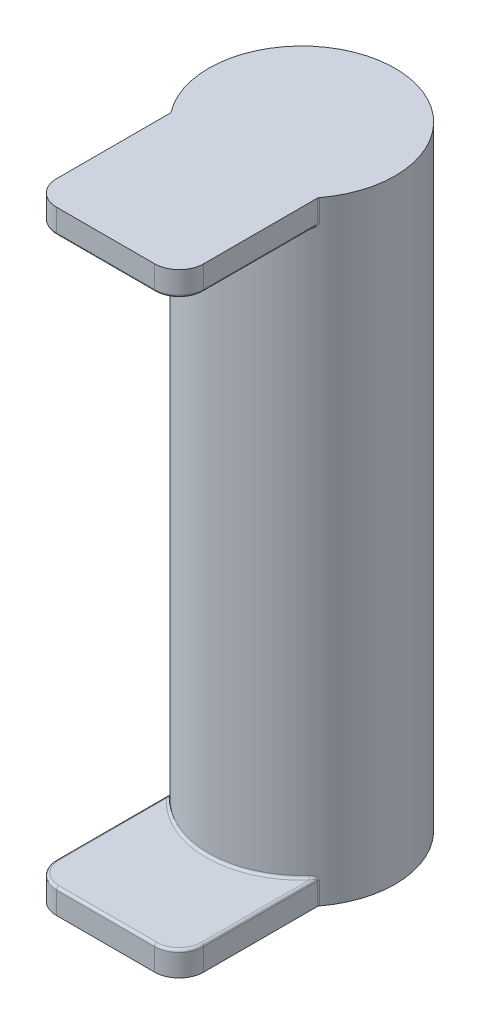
ISO-10303-21;
HEADER;
FILE_DESCRIPTION(('STEP AP214'),'2;1');
FILE_NAME('part.step','',(''),(''),'','','');
FILE_SCHEMA(('AUTOMOTIVE_DESIGN { 1 0 10303 214 1 1 1 1 }'));
ENDSEC;
DATA;
#1=APPLICATION_CONTEXT('core data for automotive mechanical design processes');
#2=APPLICATION_PROTOCOL_DEFINITION('international standard','automotive_design',2000,#1);
#3=PRODUCT_CONTEXT('',#1,'mechanical');
#4=PRODUCT('Part','Part','',(#3));
#5=PRODUCT_RELATED_PRODUCT_CATEGORY('part','',(#4));
#6=PRODUCT_DEFINITION_FORMATION('','',#4);
#7=PRODUCT_DEFINITION_CONTEXT('part definition',#1,'design');
#8=PRODUCT_DEFINITION('design','',#6,#7);
#9=PRODUCT_DEFINITION_SHAPE('','',#8);
#10=(LENGTH_UNIT() NAMED_UNIT(*) SI_UNIT(.MILLI.,.METRE.));
#11=(NAMED_UNIT(*) PLANE_ANGLE_UNIT() SI_UNIT($,.RADIAN.));
#12=(NAMED_UNIT(*) SI_UNIT($,.STERADIAN.) SOLID_ANGLE_UNIT());
#13=UNCERTAINTY_MEASURE_WITH_UNIT(LENGTH_MEASURE(1.E-05),#10,'distance_accuracy_value','');
#14=(GEOMETRIC_REPRESENTATION_CONTEXT(3) GLOBAL_UNCERTAINTY_ASSIGNED_CONTEXT((#13)) GLOBAL_UNIT_ASSIGNED_CONTEXT((#10,
#11,#12)) REPRESENTATION_CONTEXT('',''));
#15=CARTESIAN_POINT('',(0.,0.,0.));
#16=DIRECTION('',(0.,0.,1.));
#17=DIRECTION('',(1.,0.,0.));
#18=AXIS2_PLACEMENT_3D('',#15,#16,#17);
#19=CARTESIAN_POINT('',(0.,125.,0.));
#20=DIRECTION('',(0.,-1.,0.));
#21=DIRECTION('',(0.,0.,-1.));
#22=AXIS2_PLACEMENT_3D('',#19,#20,#21);
#23=CYLINDRICAL_SURFACE('',#22,19.);
#24=CARTESIAN_POINT('',(0.,125.,0.));
#25=DIRECTION('',(0.,1.,0.));
#26=DIRECTION('',(0.,0.,1.));
#27=AXIS2_PLACEMENT_3D('',#24,#25,#26);
#28=CIRCLE('',#27,19.);
#29=CARTESIAN_POINT('',(15.1025641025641,125.,11.5287708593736));
#30=VERTEX_POINT('',#29);
#31=CARTESIAN_POINT('',(-15.1025641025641,125.,11.5287708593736));
#32=VERTEX_POINT('',#31);
#33=EDGE_CURVE('E238',#30,#32,#28,.T.);
#34=ORIENTED_EDGE('',*,*,#33,.F.);
#35=DIRECTION('',(0.,-1.,0.));
#36=VECTOR('',#35,1.);
#37=CARTESIAN_POINT('',(15.1025641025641,125.,11.5287708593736));
#38=LINE('',#37,#36);
#39=CARTESIAN_POINT('',(15.1025641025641,120.5,11.5287708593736));
#40=VERTEX_POINT('',#39);
#41=EDGE_CURVE('E452',#30,#40,#38,.T.);
#42=ORIENTED_EDGE('',*,*,#41,.T.);
#43=CARTESIAN_POINT('',(15.0736156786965,120.741945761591,11.5665945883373));
#44=CARTESIAN_POINT('',(14.9720243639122,120.673590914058,11.6989886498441));
#45=CARTESIAN_POINT('',(14.9851448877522,120.620972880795,11.8709786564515));
#46=CARTESIAN_POINT('',(15.0782822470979,120.722741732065,11.5605129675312));
#47=CARTESIAN_POINT('',(14.9765233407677,120.659985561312,11.6932359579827));
#48=CARTESIAN_POINT('',(14.9875395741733,120.611370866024,11.8647369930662));
#49=CARTESIAN_POINT('',(15.082439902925,120.703192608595,11.5550872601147));
#50=CARTESIAN_POINT('',(14.9805405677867,120.646055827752,11.6880925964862));
#51=CARTESIAN_POINT('',(14.9896731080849,120.601596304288,11.8591685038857));
#52=CARTESIAN_POINT('',(15.0896525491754,120.663510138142,11.5456667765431));
#53=CARTESIAN_POINT('',(14.9875095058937,120.617696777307,11.6791627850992));
#54=CARTESIAN_POINT('',(14.9933743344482,120.581755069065,11.849500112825));
#55=CARTESIAN_POINT('',(15.0927066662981,120.643376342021,11.5416731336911));
#56=CARTESIAN_POINT('',(14.9904641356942,120.603260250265,11.6753726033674));
#57=CARTESIAN_POINT('',(14.9949415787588,120.571688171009,11.8454013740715));
#58=CARTESIAN_POINT('',(15.1000409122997,120.582596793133,11.5320785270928));
#59=CARTESIAN_POINT('',(14.9975514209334,120.559620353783,11.6662772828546));
#60=CARTESIAN_POINT('',(14.9987052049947,120.541298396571,11.8355542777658));
#61=CARTESIAN_POINT('',(15.1025626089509,120.541292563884,11.5287728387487));
#62=CARTESIAN_POINT('',(14.9999984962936,120.529788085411,11.6631306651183));
#63=CARTESIAN_POINT('',(14.9999992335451,120.52064628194,11.8321615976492));
#64=CARTESIAN_POINT('',(15.1025656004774,120.45858855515,11.5287688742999));
#65=CARTESIAN_POINT('',(15.0000015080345,120.470126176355,11.6631267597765));
#66=CARTESIAN_POINT('',(15.0000007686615,120.479294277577,11.8321575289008));
#67=CARTESIAN_POINT('',(15.1000323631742,120.417188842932,11.5320896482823));
#68=CARTESIAN_POINT('',(14.9975433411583,120.44022360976,11.6662876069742));
#69=CARTESIAN_POINT('',(14.9987008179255,120.458594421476,11.8355656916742));
#70=CARTESIAN_POINT('',(15.0902093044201,120.336072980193,11.544940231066));
#71=CARTESIAN_POINT('',(14.9880449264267,120.381951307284,11.6784772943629));
#72=CARTESIAN_POINT('',(14.9936600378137,120.418036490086,11.848754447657));
#73=CARTESIAN_POINT('',(15.0829195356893,120.296356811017,11.5544699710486));
#74=CARTESIAN_POINT('',(14.9809827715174,120.353517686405,11.6875342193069));
#75=CARTESIAN_POINT('',(14.9899192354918,120.398178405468,11.8585349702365));
#76=CARTESIAN_POINT('',(15.0644053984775,120.220136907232,11.5785972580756));
#77=CARTESIAN_POINT('',(14.9631158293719,120.299451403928,11.7103793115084));
#78=CARTESIAN_POINT('',(14.9804185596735,120.360068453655,11.8832971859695));
#79=CARTESIAN_POINT('',(15.0532213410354,120.183604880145,11.5931428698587));
#80=CARTESIAN_POINT('',(14.9523144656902,120.273750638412,11.7241634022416));
#81=CARTESIAN_POINT('',(14.9746793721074,120.34180244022,11.8982255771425));
#82=CARTESIAN_POINT('',(15.0276857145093,120.113752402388,11.6262247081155));
#83=CARTESIAN_POINT('',(14.9277474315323,120.225229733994,11.755399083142));
#84=CARTESIAN_POINT('',(14.9615755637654,120.306876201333,11.9321779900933));
#85=CARTESIAN_POINT('',(15.0133298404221,120.080436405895,11.6447663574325));
#86=CARTESIAN_POINT('',(14.9139393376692,120.20239347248,11.7729038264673));
#87=CARTESIAN_POINT('',(14.9542087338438,120.290218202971,11.9512075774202));
#88=CARTESIAN_POINT('',(14.9732899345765,119.999155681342,11.6962453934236));
#89=CARTESIAN_POINT('',(14.8755014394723,120.147503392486,11.821422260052));
#90=CARTESIAN_POINT('',(14.9336619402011,120.249577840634,12.0040413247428));
#91=CARTESIAN_POINT('',(14.945799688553,119.953603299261,11.7313820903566));
#92=CARTESIAN_POINT('',(14.8491906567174,120.117750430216,11.8544440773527));
#93=CARTESIAN_POINT('',(14.9195551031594,120.226801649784,12.0401026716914));
#94=CARTESIAN_POINT('',(14.8866081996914,119.870052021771,11.8064053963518));
#95=CARTESIAN_POINT('',(14.7929940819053,120.065260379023,11.9244276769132));
#96=CARTESIAN_POINT('',(14.8891805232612,120.185026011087,12.1171002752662));
#97=CARTESIAN_POINT('',(14.8548920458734,119.832081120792,11.8463087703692));
#98=CARTESIAN_POINT('',(14.7629762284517,120.042600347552,11.9615440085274));
#99=CARTESIAN_POINT('',(14.8729051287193,120.166040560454,12.1580537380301));
#100=CARTESIAN_POINT('',(14.770312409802,119.744119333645,11.9517598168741));
#101=CARTESIAN_POINT('',(14.6832564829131,119.992970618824,12.0592983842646));
#102=CARTESIAN_POINT('',(14.8295024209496,120.122059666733,12.2662798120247));
#103=CARTESIAN_POINT('',(14.7153642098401,119.698899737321,12.019404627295));
#104=CARTESIAN_POINT('',(14.6320533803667,119.971046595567,12.1213140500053));
#105=CARTESIAN_POINT('',(14.8013053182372,120.099449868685,12.3357047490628));
#106=CARTESIAN_POINT('',(14.6008661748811,119.622741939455,12.158242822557));
#107=CARTESIAN_POINT('',(14.5273541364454,119.941251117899,12.2464566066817));
#108=CARTESIAN_POINT('',(14.7425497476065,120.061370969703,12.4781965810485));
#109=CARTESIAN_POINT('',(14.5413094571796,119.591825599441,12.2294414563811));
#110=CARTESIAN_POINT('',(14.4735909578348,119.933831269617,12.3098442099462));
#111=CARTESIAN_POINT('',(14.7119877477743,120.045912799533,12.5512688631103));
#112=CARTESIAN_POINT('',(14.4235770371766,119.545025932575,12.3680258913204));
#113=CARTESIAN_POINT('',(14.3701016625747,119.93242656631,12.4303095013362));
#114=CARTESIAN_POINT('',(14.6515724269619,120.022512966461,12.6935002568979));
#115=CARTESIAN_POINT('',(14.365626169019,119.528198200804,12.4353031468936));
#116=CARTESIAN_POINT('',(14.3200828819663,119.937922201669,12.4877899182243));
#117=CARTESIAN_POINT('',(14.6218344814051,120.014099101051,12.7625479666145));
#118=CARTESIAN_POINT('',(14.248024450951,119.505695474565,12.5698762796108));
#119=CARTESIAN_POINT('',(14.2218311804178,119.960235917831,12.5994629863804));
#120=CARTESIAN_POINT('',(14.5614862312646,120.002847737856,12.9006624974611));
#121=CARTESIAN_POINT('',(14.1883769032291,119.500000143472,12.6371718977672));
#122=CARTESIAN_POINT('',(14.1735243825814,119.977541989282,12.6536890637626));
#123=CARTESIAN_POINT('',(14.5308776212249,120.000000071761,12.9697290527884));
#124=CARTESIAN_POINT('',(14.0526634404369,119.499999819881,12.7880938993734));
#125=CARTESIAN_POINT('',(14.0682759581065,120.029697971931,12.7707314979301));
#126=CARTESIAN_POINT('',(14.4612351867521,119.999999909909,13.124622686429));
#127=CARTESIAN_POINT('',(13.9762955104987,119.508975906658,12.8715009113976));
#128=CARTESIAN_POINT('',(14.0131443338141,120.068626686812,12.8311553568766));
#129=CARTESIAN_POINT('',(14.4220463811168,120.00448795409,13.210224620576));
#130=CARTESIAN_POINT('',(13.8621028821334,119.537171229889,12.9940475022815));
#131=CARTESIAN_POINT('',(13.9408898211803,120.138339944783,12.9099229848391));
#132=CARTESIAN_POINT('',(14.3634475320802,120.018585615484,13.3359961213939));
#133=CARTESIAN_POINT('',(13.8239857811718,119.549082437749,13.0345856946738));
#134=CARTESIAN_POINT('',(13.9180111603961,120.164400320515,12.9347737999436));
#135=CARTESIAN_POINT('',(14.3438874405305,120.024541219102,13.3776011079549));
#136=CARTESIAN_POINT('',(13.7482836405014,119.578220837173,13.1144096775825));
#137=CARTESIAN_POINT('',(13.8765568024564,120.220327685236,12.9798486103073));
#138=CARTESIAN_POINT('',(14.3050402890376,120.039110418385,13.4595257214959));
#139=CARTESIAN_POINT('',(13.7106992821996,119.595454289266,13.1536939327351));
#140=CARTESIAN_POINT('',(13.8581349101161,120.250367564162,12.999907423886));
#141=CARTESIAN_POINT('',(14.285753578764,120.047727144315,13.4998437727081));
#142=CARTESIAN_POINT('',(13.6735939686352,119.61551815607,13.192150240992));
#143=CARTESIAN_POINT('',(13.8429110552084,120.281319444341,13.016653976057));
#144=CARTESIAN_POINT('',(14.2667126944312,120.057759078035,13.5393120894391));
#145=(BOUNDED_SURFACE() B_SPLINE_SURFACE(3,2,((#43,#44,#45),(#46,#47,#48),(#49,#50,#51),(#52,
#53,#54),(#55,#56,#57),(#58,#59,#60),(#61,#62,#63),(#64,#65,#66),(#67,#68,#69),(#70,#71,#72),
(#73,#74,#75),(#76,#77,#78),(#79,#80,#81),(#82,#83,#84),(#85,#86,#87),(#88,#89,#90),(#91,#92,
#93),(#94,#95,#96),(#97,#98,#99),(#100,#101,#102),(#103,#104,#105),(#106,#107,#108),(#109,#110,
#111),(#112,#113,#114),(#115,#116,#117),(#118,#119,#120),(#121,#122,#123),(#124,#125,#126),
(#127,#128,#129),(#130,#131,#132),(#133,#134,#135),(#136,#137,#138),(#139,#140,#141),(#142,#143,
#144)),.UNSPECIFIED.,.F.,.F.,.F.) B_SPLINE_SURFACE_WITH_KNOTS((4,2,2,2,2,2,2,2,2,2,2,2,2,2,2,2,
4),(3,3),(0.,0.0622260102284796,0.124501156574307,0.248154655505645,0.372164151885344,
0.496172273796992,0.618933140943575,0.741861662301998,0.934530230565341,1.12789757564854,
1.42693845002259,1.72643488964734,2.00373249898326,2.28052306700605,2.62801533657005,
2.80280378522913,2.97779862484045),(0.,1.),
.UNSPECIFIED.) GEOMETRIC_REPRESENTATION_ITEM() RATIONAL_B_SPLINE_SURFACE(((1.,0.940685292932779,
1.),(1.,0.941758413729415,1.),(1.,0.942713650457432,1.),(1.,0.944369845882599,1.),(1.,
0.945070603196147,1.),(1.,0.946752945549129,1.),(1.,0.947330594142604,1.),(1.,0.947331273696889,
1.),(1.,0.946750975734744,1.),(1.,0.94449776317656,1.),(1.,0.942824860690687,1.),(1.,
0.938567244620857,1.),(1.,0.935991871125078,1.),(1.,0.930096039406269,1.),(1.,0.926774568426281,
1.),(1.,0.917480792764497,1.),(1.,0.911073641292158,1.),(1.,0.897190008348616,1.),(1.,
0.889709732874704,1.),(1.,0.869613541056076,1.),(1.,0.856425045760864,1.),(1.,0.828551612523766,
1.),(1.,0.813864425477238,1.),(1.,0.784333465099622,1.),(1.,0.769581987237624,1.),(1.,
0.739085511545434,1.),(1.,0.723342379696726,1.),(1.,0.686724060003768,1.),(1.,0.665565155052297,
1.),(1.,0.632814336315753,1.),(1.,0.621694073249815,1.),(1.,0.599180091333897,1.),(1.,
0.58778606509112,1.),(1.,0.576291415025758,1.))) REPRESENTATION_ITEM('') SURFACE());
#146=CARTESIAN_POINT('',(15.0736156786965,120.741945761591,11.5665945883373));
#147=CARTESIAN_POINT('',(15.0782822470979,120.722741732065,11.5605129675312));
#148=CARTESIAN_POINT('',(15.082439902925,120.703192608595,11.5550872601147));
#149=CARTESIAN_POINT('',(15.0896525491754,120.663510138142,11.5456667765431));
#150=CARTESIAN_POINT('',(15.0927066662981,120.643376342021,11.5416731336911));
#151=CARTESIAN_POINT('',(15.1000409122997,120.582596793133,11.5320785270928));
#152=CARTESIAN_POINT('',(15.102562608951,120.541292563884,11.5287728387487));
#153=CARTESIAN_POINT('',(15.1025656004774,120.45858855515,11.5287688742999));
#154=CARTESIAN_POINT('',(15.1000323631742,120.417188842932,11.5320896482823));
#155=CARTESIAN_POINT('',(15.0902093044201,120.336072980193,11.544940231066));
#156=CARTESIAN_POINT('',(15.0829195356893,120.296356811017,11.5544699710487));
#157=CARTESIAN_POINT('',(15.0644053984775,120.220136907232,11.5785972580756));
#158=CARTESIAN_POINT('',(15.0532213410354,120.183604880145,11.5931428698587));
#159=CARTESIAN_POINT('',(15.0276857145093,120.113752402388,11.6262247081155));
#160=CARTESIAN_POINT('',(15.0133298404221,120.080436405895,11.6447663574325));
#161=CARTESIAN_POINT('',(14.9732899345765,119.999155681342,11.6962453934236));
#162=CARTESIAN_POINT('',(14.945799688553,119.953603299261,11.7313820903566));
#163=CARTESIAN_POINT('',(14.8866081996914,119.870052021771,11.8064053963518));
#164=CARTESIAN_POINT('',(14.8548920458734,119.832081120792,11.8463087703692));
#165=CARTESIAN_POINT('',(14.770312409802,119.744119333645,11.9517598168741));
#166=CARTESIAN_POINT('',(14.7153642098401,119.698899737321,12.019404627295));
#167=CARTESIAN_POINT('',(14.6008661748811,119.622741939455,12.158242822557));
#168=CARTESIAN_POINT('',(14.5413094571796,119.591825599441,12.2294414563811));
#169=CARTESIAN_POINT('',(14.4235770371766,119.545025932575,12.3680258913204));
#170=CARTESIAN_POINT('',(14.365626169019,119.528198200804,12.4353031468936));
#171=CARTESIAN_POINT('',(14.248024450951,119.505695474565,12.5698762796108));
#172=CARTESIAN_POINT('',(14.1883769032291,119.500000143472,12.6371718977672));
#173=CARTESIAN_POINT('',(14.0526634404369,119.499999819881,12.7880938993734));
#174=CARTESIAN_POINT('',(13.9762955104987,119.508975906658,12.8715009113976));
#175=CARTESIAN_POINT('',(13.8621028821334,119.537171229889,12.9940475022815));
#176=CARTESIAN_POINT('',(13.8239857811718,119.549082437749,13.0345856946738));
#177=CARTESIAN_POINT('',(13.7482836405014,119.578220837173,13.1144096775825));
#178=CARTESIAN_POINT('',(13.7106992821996,119.595454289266,13.1536939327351));
#179=CARTESIAN_POINT('',(13.6735939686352,119.61551815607,13.192150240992));
#180=B_SPLINE_CURVE_WITH_KNOTS('',3,(#146,#147,#148,#149,#150,#151,#152,#153,#154,#155,#156,
#157,#158,#159,#160,#161,#162,#163,#164,#165,#166,#167,#168,#169,#170,#171,#172,#173,#174,#175,
#176,#177,#178,#179),.UNSPECIFIED.,.F.,.F.,(4,2,2,2,2,2,2,2,2,2,2,2,2,2,2,2,4),(0.,
0.0622260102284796,0.124501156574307,0.248154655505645,0.372164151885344,0.496172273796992,
0.618933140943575,0.741861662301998,0.934530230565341,1.12789757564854,1.42693845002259,
1.72643488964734,2.00373249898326,2.28052306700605,2.62801533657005,2.80280378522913,
2.97779862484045),.UNSPECIFIED.);
#181=CARTESIAN_POINT('',(14.1282051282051,119.5,12.7040867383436));
#182=VERTEX_POINT('',#181);
#183=EDGE_CURVE('E446',#40,#182,#180,.T.);
#184=ORIENTED_EDGE('',*,*,#183,.T.);
#185=CARTESIAN_POINT('',(0.,119.5,0.));
#186=DIRECTION('',(0.,-1.,0.));
#187=DIRECTION('',(0.,0.,-1.));
#188=AXIS2_PLACEMENT_3D('',#185,#186,#187);
#189=CIRCLE('',#188,19.);
#190=CARTESIAN_POINT('',(-14.1282051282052,119.5,12.7040867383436));
#191=VERTEX_POINT('',#190);
#192=EDGE_CURVE('E436',#182,#191,#189,.T.);
#193=ORIENTED_EDGE('',*,*,#192,.T.);
#194=CARTESIAN_POINT('',(-13.6735939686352,119.61551815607,13.1921502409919));
#195=CARTESIAN_POINT('',(-13.8429110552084,120.281319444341,13.016653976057));
#196=CARTESIAN_POINT('',(-14.2667126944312,120.057759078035,13.5393120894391));
#197=CARTESIAN_POINT('',(-13.7106030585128,119.595505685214,13.1537938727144));
#198=CARTESIAN_POINT('',(-13.8580951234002,120.250445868,12.9999514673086));
#199=CARTESIAN_POINT('',(-14.2857042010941,120.047752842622,13.4999463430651));
#200=CARTESIAN_POINT('',(-13.7480916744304,119.578308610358,13.1146104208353));
#201=CARTESIAN_POINT('',(-13.8764640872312,120.220478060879,12.9799497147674));
#202=CARTESIAN_POINT('',(-14.3049417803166,120.039154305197,13.4597317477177));
#203=CARTESIAN_POINT('',(-13.8235936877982,119.549219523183,13.0350007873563));
#204=CARTESIAN_POINT('',(-13.9177885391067,120.164676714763,12.9350155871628));
#205=CARTESIAN_POINT('',(-14.3436862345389,120.024609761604,13.3780271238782));
#206=CARTESIAN_POINT('',(-13.8616063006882,119.537320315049,12.9945763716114));
#207=CARTESIAN_POINT('',(-13.9405902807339,120.138671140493,12.9102483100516));
#208=CARTESIAN_POINT('',(-14.3631927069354,120.01866015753,13.3365389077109));
#209=CARTESIAN_POINT('',(-13.9758869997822,119.50902444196,12.8719472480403));
#210=CARTESIAN_POINT('',(-14.0128399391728,120.06884138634,12.8314893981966));
#211=CARTESIAN_POINT('',(-14.4218367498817,120.00451222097,13.2106827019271));
#212=CARTESIAN_POINT('',(-14.0524447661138,119.500005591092,12.7883382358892));
#213=CARTESIAN_POINT('',(-14.0680970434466,120.029783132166,12.7709329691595));
#214=CARTESIAN_POINT('',(-14.4611229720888,120.000002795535,13.1248734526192));
#215=CARTESIAN_POINT('',(-14.2105606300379,119.499993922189,12.6125009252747));
#216=CARTESIAN_POINT('',(-14.189723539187,119.969518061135,12.6356720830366));
#217=CARTESIAN_POINT('',(-14.542261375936,119.999996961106,12.9444088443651));
#218=CARTESIAN_POINT('',(-14.2919738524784,119.510638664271,12.5201558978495));
#219=CARTESIAN_POINT('',(-14.2568451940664,119.948494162,12.560088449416));
#220=CARTESIAN_POINT('',(-14.5840392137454,120.005319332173,12.8496336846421));
#221=CARTESIAN_POINT('',(-14.4508981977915,119.552679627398,12.3363785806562));
#222=CARTESIAN_POINT('',(-14.3925994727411,119.929855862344,12.4044455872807));
#223=CARTESIAN_POINT('',(-14.6655924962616,120.026339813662,12.6610201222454));
#224=CARTESIAN_POINT('',(-14.5284086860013,119.584079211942,12.2449464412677));
#225=CARTESIAN_POINT('',(-14.4614832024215,119.931025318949,12.3242357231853));
#226=CARTESIAN_POINT('',(-14.7053676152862,120.042039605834,12.5671818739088));
#227=CARTESIAN_POINT('',(-14.6513120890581,119.654402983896,12.0973096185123));
#228=CARTESIAN_POINT('',(-14.5735165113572,119.952771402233,12.1914650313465));
#229=CARTESIAN_POINT('',(-14.768436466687,120.077201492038,12.4156598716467));
#230=CARTESIAN_POINT('',(-14.6985886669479,119.687033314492,12.0397966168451));
#231=CARTESIAN_POINT('',(-14.6170025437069,119.96609211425,12.1393600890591));
#232=CARTESIAN_POINT('',(-14.7926968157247,120.093516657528,12.3566333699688));
#233=CARTESIAN_POINT('',(-14.789161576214,119.762820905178,11.9283611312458));
#234=CARTESIAN_POINT('',(-14.7010143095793,120.00336083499,12.0375985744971));
#235=CARTESIAN_POINT('',(-14.8391750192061,120.131410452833,12.2422653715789));
#236=CARTESIAN_POINT('',(-14.8324672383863,119.805952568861,11.8744303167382));
#237=CARTESIAN_POINT('',(-14.7417231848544,120.027068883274,11.9877507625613));
#238=CARTESIAN_POINT('',(-14.8613976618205,120.152976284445,12.1869153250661));
#239=CARTESIAN_POINT('',(-14.8999049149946,119.887975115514,11.7896032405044));
#240=CARTESIAN_POINT('',(-14.805625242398,120.076420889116,11.9087402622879));
#241=CARTESIAN_POINT('',(-14.8960038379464,120.193987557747,12.0998559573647));
#242=CARTESIAN_POINT('',(-14.9256503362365,119.923573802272,11.7569758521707));
#243=CARTESIAN_POINT('',(-14.8301069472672,120.098677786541,11.8782598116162));
#244=CARTESIAN_POINT('',(-14.9092153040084,120.211786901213,12.0663699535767));
#245=CARTESIAN_POINT('',(-14.9735730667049,120.000669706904,11.6958798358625));
#246=CARTESIAN_POINT('',(-14.875776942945,120.14863770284,11.8210712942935));
#247=CARTESIAN_POINT('',(-14.9338072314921,120.250334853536,12.0036661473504));
#248=CARTESIAN_POINT('',(-14.9957540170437,120.042160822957,11.6674069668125));
#249=CARTESIAN_POINT('',(-14.897051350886,120.176316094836,11.7942600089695));
#250=CARTESIAN_POINT('',(-14.9451895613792,120.271080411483,11.9744439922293));
#251=CARTESIAN_POINT('',(-15.0300997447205,120.11982218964,11.6231097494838));
#252=CARTESIAN_POINT('',(-14.9300517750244,120.229399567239,11.7524801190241));
#253=CARTESIAN_POINT('',(-14.9628143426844,120.309911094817,11.9289810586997));
#254=CARTESIAN_POINT('',(-15.0433754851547,120.154641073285,11.6059126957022));
#255=CARTESIAN_POINT('',(-14.9428436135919,120.253538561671,11.7362181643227));
#256=CARTESIAN_POINT('',(-14.9696268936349,120.327320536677,11.9113314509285));
#257=CARTESIAN_POINT('',(-15.0663922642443,120.227377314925,11.5760174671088));
#258=CARTESIAN_POINT('',(-14.9650178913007,120.304540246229,11.7079556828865));
#259=CARTESIAN_POINT('',(-14.9814381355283,120.363688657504,11.8806495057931));
#260=CARTESIAN_POINT('',(-15.076141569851,120.265287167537,11.5633087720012));
#261=CARTESIAN_POINT('',(-14.9744463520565,120.331424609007,11.6958971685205));
#262=CARTESIAN_POINT('',(-14.9864410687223,120.382643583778,11.8676063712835));
#263=CARTESIAN_POINT('',(-15.0898650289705,120.335899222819,11.5453919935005));
#264=CARTESIAN_POINT('',(-14.9877079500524,120.381834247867,11.678911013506));
#265=CARTESIAN_POINT('',(-14.9934833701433,120.417949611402,11.8492180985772));
#266=CARTESIAN_POINT('',(-15.0945928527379,120.368183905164,11.5392068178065));
#267=CARTESIAN_POINT('',(-14.9922864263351,120.405013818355,11.6730350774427));
#268=CARTESIAN_POINT('',(-14.9959094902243,120.43409195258,11.8428701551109));
#269=CARTESIAN_POINT('',(-15.1009448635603,120.433637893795,11.5308929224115));
#270=CARTESIAN_POINT('',(-14.998430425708,120.45210686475,11.6651464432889));
#271=CARTESIAN_POINT('',(-14.9991690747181,120.4668189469,11.8343374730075));
#272=CARTESIAN_POINT('',(-15.1025675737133,120.466807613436,11.5287661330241));
#273=CARTESIAN_POINT('',(-15.000003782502,120.476055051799,11.6631236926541));
#274=CARTESIAN_POINT('',(-15.000001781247,120.483403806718,11.8321547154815));
#275=CARTESIAN_POINT('',(-15.1025597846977,120.54128900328,11.5287767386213));
#276=CARTESIAN_POINT('',(-14.9999952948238,120.529785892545,11.6631349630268));
#277=CARTESIAN_POINT('',(-14.9999977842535,120.520644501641,11.8321656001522));
#278=CARTESIAN_POINT('',(-15.100039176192,120.582613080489,11.5320808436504));
#279=CARTESIAN_POINT('',(-14.9975496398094,120.559632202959,11.6662796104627));
#280=CARTESIAN_POINT('',(-14.9987043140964,120.541306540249,11.8355566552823));
#281=CARTESIAN_POINT('',(-15.0927033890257,120.643402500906,11.5416773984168));
#282=CARTESIAN_POINT('',(-14.9904610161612,120.603278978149,11.6753765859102));
#283=CARTESIAN_POINT('',(-14.9949398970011,120.57170125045,11.8454057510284));
#284=CARTESIAN_POINT('',(-15.0896490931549,120.663532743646,11.5456712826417));
#285=CARTESIAN_POINT('',(-14.9875061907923,120.617712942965,11.6791670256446));
#286=CARTESIAN_POINT('',(-14.9933725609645,120.581766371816,11.8495047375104));
#287=CARTESIAN_POINT('',(-15.0824370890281,120.703204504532,11.5550909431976));
#288=CARTESIAN_POINT('',(-14.9805378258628,120.646064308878,11.6880961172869));
#289=CARTESIAN_POINT('',(-14.9896716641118,120.601602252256,11.8591722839));
#290=CARTESIAN_POINT('',(-15.0782804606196,120.722746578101,11.5605153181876));
#291=CARTESIAN_POINT('',(-14.9765215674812,120.659989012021,11.6932382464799));
#292=CARTESIAN_POINT('',(-14.9875386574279,120.611373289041,11.8647394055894));
#293=CARTESIAN_POINT('',(-15.0736156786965,120.741945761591,11.5665945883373));
#294=CARTESIAN_POINT('',(-14.9720243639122,120.673590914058,11.6989886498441));
#295=CARTESIAN_POINT('',(-14.9851448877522,120.620972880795,11.8709786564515));
#296=(BOUNDED_SURFACE() B_SPLINE_SURFACE(3,2,((#194,#195,#196),(#197,#198,#199),(#200,#201,
#202),(#203,#204,#205),(#206,#207,#208),(#209,#210,#211),(#212,#213,#214),(#215,#216,#217),
(#218,#219,#220),(#221,#222,#223),(#224,#225,#226),(#227,#228,#229),(#230,#231,#232),(#233,#234,
#235),(#236,#237,#238),(#239,#240,#241),(#242,#243,#244),(#245,#246,#247),(#248,#249,#250),
(#251,#252,#253),(#254,#255,#256),(#257,#258,#259),(#260,#261,#262),(#263,#264,#265),(#266,#267,
#268),(#269,#270,#271),(#272,#273,#274),(#275,#276,#277),(#278,#279,#280),(#281,#282,#283),
(#284,#285,#286),(#287,#288,#289),(#290,#291,#292),(#293,#294,#295)),.UNSPECIFIED.,.F.,.F.,
.F.) B_SPLINE_SURFACE_WITH_KNOTS((4,2,2,2,2,2,2,2,2,2,2,2,2,2,2,2,4),(3,3),(0.,
0.174550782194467,0.348863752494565,0.697273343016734,1.07601290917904,1.45481386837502,
1.70344140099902,1.951468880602,2.11770243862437,2.28376509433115,2.40737472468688,
2.53069267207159,2.63007358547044,2.7295017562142,2.85318343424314,2.91545025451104,
2.9776563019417),(0.,1.),
.UNSPECIFIED.) GEOMETRIC_REPRESENTATION_ITEM() RATIONAL_B_SPLINE_SURFACE(((1.,0.576291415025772,
1.),(1.,0.58775629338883,1.),(1.,0.599121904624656,1.),(1.,0.621578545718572,1.),(1.,
0.632669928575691,1.),(1.,0.665451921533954,1.),(1.,0.686664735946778,1.),(1.,0.729328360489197,
1.),(1.,0.750639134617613,1.),(1.,0.791320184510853,1.),(1.,0.810690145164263,1.),(1.,
0.84087822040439,1.),(1.,0.852347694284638,1.),(1.,0.874110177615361,1.),(1.,0.884405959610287,
1.),(1.,0.900316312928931,1.),(1.,0.906354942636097,1.),(1.,0.917546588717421,1.),(1.,
0.922700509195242,1.),(1.,0.930654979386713,1.),(1.,0.933720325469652,1.),(1.,0.939025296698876,
1.),(1.,0.941266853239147,1.),(1.,0.944418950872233,1.),(1.,0.94550339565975,1.),(1.,
0.946959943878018,1.),(1.,0.94733170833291,1.),(1.,0.947329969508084,1.),(1.,0.946752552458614,
1.),(1.,0.945069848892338,1.),(1.,0.944369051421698,1.),(1.,0.942713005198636,1.),(1.,
0.941758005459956,1.),(1.,0.940685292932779,1.))) REPRESENTATION_ITEM('') SURFACE());
#297=CARTESIAN_POINT('',(-13.6735939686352,119.61551815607,13.1921502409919));
#298=CARTESIAN_POINT('',(-13.7106030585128,119.595505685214,13.1537938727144));
#299=CARTESIAN_POINT('',(-13.7480916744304,119.578308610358,13.1146104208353));
#300=CARTESIAN_POINT('',(-13.8235936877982,119.549219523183,13.0350007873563));
#301=CARTESIAN_POINT('',(-13.8616063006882,119.537320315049,12.9945763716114));
#302=CARTESIAN_POINT('',(-13.9758869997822,119.50902444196,12.8719472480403));
#303=CARTESIAN_POINT('',(-14.0524447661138,119.500005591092,12.7883382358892));
#304=CARTESIAN_POINT('',(-14.2105606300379,119.499993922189,12.6125009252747));
#305=CARTESIAN_POINT('',(-14.2919738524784,119.510638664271,12.5201558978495));
#306=CARTESIAN_POINT('',(-14.4508981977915,119.552679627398,12.3363785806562));
#307=CARTESIAN_POINT('',(-14.5284086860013,119.584079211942,12.2449464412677));
#308=CARTESIAN_POINT('',(-14.6513120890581,119.654402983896,12.0973096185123));
#309=CARTESIAN_POINT('',(-14.6985886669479,119.687033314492,12.0397966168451));
#310=CARTESIAN_POINT('',(-14.789161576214,119.762820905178,11.9283611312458));
#311=CARTESIAN_POINT('',(-14.8324672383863,119.805952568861,11.8744303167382));
#312=CARTESIAN_POINT('',(-14.8999049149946,119.887975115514,11.7896032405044));
#313=CARTESIAN_POINT('',(-14.9256503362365,119.923573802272,11.7569758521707));
#314=CARTESIAN_POINT('',(-14.9735730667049,120.000669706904,11.6958798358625));
#315=CARTESIAN_POINT('',(-14.9957540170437,120.042160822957,11.6674069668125));
#316=CARTESIAN_POINT('',(-15.0300997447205,120.11982218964,11.6231097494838));
#317=CARTESIAN_POINT('',(-15.0433754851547,120.154641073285,11.6059126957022));
#318=CARTESIAN_POINT('',(-15.0663922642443,120.227377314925,11.5760174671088));
#319=CARTESIAN_POINT('',(-15.076141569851,120.265287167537,11.5633087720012));
#320=CARTESIAN_POINT('',(-15.0898650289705,120.335899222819,11.5453919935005));
#321=CARTESIAN_POINT('',(-15.0945928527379,120.368183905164,11.5392068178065));
#322=CARTESIAN_POINT('',(-15.1009448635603,120.433637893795,11.5308929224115));
#323=CARTESIAN_POINT('',(-15.1025675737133,120.466807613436,11.5287661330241));
#324=CARTESIAN_POINT('',(-15.1025597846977,120.54128900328,11.5287767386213));
#325=CARTESIAN_POINT('',(-15.100039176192,120.582613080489,11.5320808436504));
#326=CARTESIAN_POINT('',(-15.0927033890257,120.643402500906,11.5416773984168));
#327=CARTESIAN_POINT('',(-15.0896490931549,120.663532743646,11.5456712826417));
#328=CARTESIAN_POINT('',(-15.0824370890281,120.703204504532,11.5550909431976));
#329=CARTESIAN_POINT('',(-15.0782804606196,120.722746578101,11.5605153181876));
#330=CARTESIAN_POINT('',(-15.0736156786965,120.741945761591,11.5665945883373));
#331=B_SPLINE_CURVE_WITH_KNOTS('',3,(#297,#298,#299,#300,#301,#302,#303,#304,#305,#306,#307,
#308,#309,#310,#311,#312,#313,#314,#315,#316,#317,#318,#319,#320,#321,#322,#323,#324,#325,#326,
#327,#328,#329,#330),.UNSPECIFIED.,.F.,.F.,(4,2,2,2,2,2,2,2,2,2,2,2,2,2,2,2,4),(0.,
0.174550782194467,0.348863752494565,0.697273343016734,1.07601290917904,1.45481386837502,
1.70344140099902,1.951468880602,2.11770243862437,2.28376509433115,2.40737472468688,
2.53069267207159,2.63007358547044,2.7295017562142,2.85318343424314,2.91545025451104,
2.9776563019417),.UNSPECIFIED.);
#332=CARTESIAN_POINT('',(-15.1025641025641,120.5,11.5287708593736));
#333=VERTEX_POINT('',#332);
#334=EDGE_CURVE('E438',#191,#333,#331,.T.);
#335=ORIENTED_EDGE('',*,*,#334,.T.);
#336=DIRECTION('',(0.,-1.,0.));
#337=VECTOR('',#336,1.);
#338=CARTESIAN_POINT('',(-15.1025641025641,125.,11.5287708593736));
#339=LINE('',#338,#337);
#340=EDGE_CURVE('E444',#333,#32,#339,.F.);
#341=ORIENTED_EDGE('',*,*,#340,.T.);
#342=EDGE_LOOP('',(#34,#42,#184,#193,#335,#341));
#343=FACE_BOUND('',#342,.T.);
#344=CARTESIAN_POINT('',(0.,0.,0.));
#345=DIRECTION('',(0.,1.,0.));
#346=DIRECTION('',(0.,0.,1.));
#347=AXIS2_PLACEMENT_3D('',#344,#345,#346);
#348=CIRCLE('',#347,19.);
#349=CARTESIAN_POINT('',(15.1025641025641,0.,11.5287708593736));
#350=VERTEX_POINT('',#349);
#351=CARTESIAN_POINT('',(-15.1025641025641,0.,11.5287708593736));
#352=VERTEX_POINT('',#351);
#353=EDGE_CURVE('E241',#350,#352,#348,.T.);
#354=ORIENTED_EDGE('',*,*,#353,.T.);
#355=DIRECTION('',(0.,-1.,0.));
#356=VECTOR('',#355,1.);
#357=CARTESIAN_POINT('',(-15.1025641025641,125.,11.5287708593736));
#358=LINE('',#357,#356);
#359=CARTESIAN_POINT('',(-15.1025641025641,4.5,11.5287708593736));
#360=VERTEX_POINT('',#359);
#361=EDGE_CURVE('E513',#352,#360,#358,.F.);
#362=ORIENTED_EDGE('',*,*,#361,.T.);
#363=CARTESIAN_POINT('',(-15.0736156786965,4.25805423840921,11.5665945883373));
#364=CARTESIAN_POINT('',(-14.9720243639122,4.32640908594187,11.6989886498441));
#365=CARTESIAN_POINT('',(-14.9851448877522,4.37902711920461,11.8709786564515));
#366=CARTESIAN_POINT('',(-15.0782822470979,4.27725826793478,11.5605129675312));
#367=CARTESIAN_POINT('',(-14.9765233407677,4.34001443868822,11.6932359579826));
#368=CARTESIAN_POINT('',(-14.9875395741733,4.38862913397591,11.8647369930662));
#369=CARTESIAN_POINT('',(-15.082439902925,4.29680739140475,11.5550872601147));
#370=CARTESIAN_POINT('',(-14.9805405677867,4.35394417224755,11.6880925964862));
#371=CARTESIAN_POINT('',(-14.9896731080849,4.39840369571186,11.8591685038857));
#372=CARTESIAN_POINT('',(-15.0896525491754,4.3364898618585,11.5456667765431));
#373=CARTESIAN_POINT('',(-14.9875095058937,4.38230322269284,11.6791627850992));
#374=CARTESIAN_POINT('',(-14.9933743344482,4.41824493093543,11.849500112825));
#375=CARTESIAN_POINT('',(-15.0927066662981,4.35662365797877,11.5416731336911));
#376=CARTESIAN_POINT('',(-14.9904641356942,4.39673974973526,11.6753726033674));
#377=CARTESIAN_POINT('',(-14.9949415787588,4.4283118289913,11.8454013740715));
#378=CARTESIAN_POINT('',(-15.1000409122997,4.41740320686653,11.5320785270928));
#379=CARTESIAN_POINT('',(-14.9975514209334,4.44037964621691,11.6662772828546));
#380=CARTESIAN_POINT('',(-14.9987052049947,4.45870160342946,11.8355542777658));
#381=CARTESIAN_POINT('',(-15.102562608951,4.45870743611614,11.5287728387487));
#382=CARTESIAN_POINT('',(-14.9999984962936,4.47021191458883,11.6631306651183));
#383=CARTESIAN_POINT('',(-14.9999992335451,4.4793537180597,11.8321615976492));
#384=CARTESIAN_POINT('',(-15.1025656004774,4.54141144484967,11.5287688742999));
#385=CARTESIAN_POINT('',(-15.0000015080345,4.52987382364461,11.6631267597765));
#386=CARTESIAN_POINT('',(-15.0000007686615,4.5207057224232,11.8321575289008));
#387=CARTESIAN_POINT('',(-15.1000323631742,4.58281115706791,11.5320896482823));
#388=CARTESIAN_POINT('',(-14.9975433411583,4.55977639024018,11.6662876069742));
#389=CARTESIAN_POINT('',(-14.9987008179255,4.54140557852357,11.8355656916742));
#390=CARTESIAN_POINT('',(-15.0902093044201,4.66392701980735,11.544940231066));
#391=CARTESIAN_POINT('',(-14.9880449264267,4.61804869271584,11.6784772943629));
#392=CARTESIAN_POINT('',(-14.9936600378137,4.58196350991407,11.8487544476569));
#393=CARTESIAN_POINT('',(-15.0829195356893,4.70364318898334,11.5544699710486));
#394=CARTESIAN_POINT('',(-14.9809827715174,4.64648231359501,11.6875342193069));
#395=CARTESIAN_POINT('',(-14.9899192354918,4.6018215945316,11.8585349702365));
#396=CARTESIAN_POINT('',(-15.0644053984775,4.77986309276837,11.5785972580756));
#397=CARTESIAN_POINT('',(-14.9631158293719,4.70054859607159,11.7103793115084));
#398=CARTESIAN_POINT('',(-14.9804185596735,4.63993154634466,11.8832971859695));
#399=CARTESIAN_POINT('',(-15.0532213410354,4.81639511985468,11.5931428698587));
#400=CARTESIAN_POINT('',(-14.9523144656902,4.72624936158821,11.7241634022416));
#401=CARTESIAN_POINT('',(-14.9746793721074,4.65819755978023,11.8982255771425));
#402=CARTESIAN_POINT('',(-15.0276857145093,4.88624759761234,11.6262247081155));
#403=CARTESIAN_POINT('',(-14.9277474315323,4.77477026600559,11.755399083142));
#404=CARTESIAN_POINT('',(-14.9615755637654,4.69312379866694,11.9321779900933));
#405=CARTESIAN_POINT('',(-15.0133298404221,4.91956359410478,11.6447663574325));
#406=CARTESIAN_POINT('',(-14.9139393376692,4.79760652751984,11.7729038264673));
#407=CARTESIAN_POINT('',(-14.9542087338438,4.70978179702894,11.9512075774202));
#408=CARTESIAN_POINT('',(-14.9732899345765,5.00084431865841,11.6962453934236));
#409=CARTESIAN_POINT('',(-14.8755014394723,4.85249660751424,11.821422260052));
#410=CARTESIAN_POINT('',(-14.9336619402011,4.75042215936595,12.0040413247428));
#411=CARTESIAN_POINT('',(-14.945799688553,5.04639670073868,11.7313820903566));
#412=CARTESIAN_POINT('',(-14.8491906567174,4.88224956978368,11.8544440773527));
#413=CARTESIAN_POINT('',(-14.9195551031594,4.77319835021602,12.0401026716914));
#414=CARTESIAN_POINT('',(-14.8866081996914,5.12994797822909,11.8064053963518));
#415=CARTESIAN_POINT('',(-14.7929940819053,4.93473962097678,11.9244276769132));
#416=CARTESIAN_POINT('',(-14.8891805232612,4.81497398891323,12.1171002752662));
#417=CARTESIAN_POINT('',(-14.8548920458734,5.16791887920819,11.8463087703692));
#418=CARTESIAN_POINT('',(-14.7629762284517,4.95739965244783,11.9615440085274));
#419=CARTESIAN_POINT('',(-14.8729051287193,4.83395943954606,12.1580537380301));
#420=CARTESIAN_POINT('',(-14.770312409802,5.25588066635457,11.9517598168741));
#421=CARTESIAN_POINT('',(-14.6832564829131,5.00702938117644,12.0592983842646));
#422=CARTESIAN_POINT('',(-14.8295024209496,4.87794033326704,12.2662798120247));
#423=CARTESIAN_POINT('',(-14.7153642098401,5.3011002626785,12.019404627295));
#424=CARTESIAN_POINT('',(-14.6320533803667,5.02895340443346,12.1213140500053));
#425=CARTESIAN_POINT('',(-14.8013053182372,4.90055013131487,12.3357047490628));
#426=CARTESIAN_POINT('',(-14.6008661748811,5.37725806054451,12.158242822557));
#427=CARTESIAN_POINT('',(-14.5273541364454,5.05874888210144,12.2464566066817));
#428=CARTESIAN_POINT('',(-14.7425497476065,4.93862903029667,12.4781965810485));
#429=CARTESIAN_POINT('',(-14.5413094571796,5.40817440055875,12.2294414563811));
#430=CARTESIAN_POINT('',(-14.4735909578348,5.06616873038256,12.3098442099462));
#431=CARTESIAN_POINT('',(-14.7119877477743,4.95408720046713,12.5512688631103));
#432=CARTESIAN_POINT('',(-14.4235770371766,5.45497406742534,12.3680258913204));
#433=CARTESIAN_POINT('',(-14.3701016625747,5.06757343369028,12.4303095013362));
#434=CARTESIAN_POINT('',(-14.6515724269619,4.97748703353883,12.6935002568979));
#435=CARTESIAN_POINT('',(-14.365626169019,5.47180179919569,12.4353031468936));
#436=CARTESIAN_POINT('',(-14.3200828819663,5.06207779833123,12.4877899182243));
#437=CARTESIAN_POINT('',(-14.6218344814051,4.98590089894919,12.7625479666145));
#438=CARTESIAN_POINT('',(-14.248024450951,5.49430452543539,12.5698762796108));
#439=CARTESIAN_POINT('',(-14.2218311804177,5.03976408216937,12.5994629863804));
#440=CARTESIAN_POINT('',(-14.5614862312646,4.99715226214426,12.9006624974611));
#441=CARTESIAN_POINT('',(-14.1883769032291,5.49999985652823,12.6371718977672));
#442=CARTESIAN_POINT('',(-14.1735243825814,5.02245801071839,12.6536890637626));
#443=CARTESIAN_POINT('',(-14.5308776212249,4.99999992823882,12.9697290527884));
#444=CARTESIAN_POINT('',(-14.0526634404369,5.50000018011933,12.7880938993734));
#445=CARTESIAN_POINT('',(-14.0682759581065,4.97030202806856,12.7707314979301));
#446=CARTESIAN_POINT('',(-14.4612351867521,5.00000009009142,13.124622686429));
#447=CARTESIAN_POINT('',(-13.9762955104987,5.4910240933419,12.8715009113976));
#448=CARTESIAN_POINT('',(-14.0131443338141,4.93137331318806,12.8311553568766));
#449=CARTESIAN_POINT('',(-14.4220463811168,4.99551204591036,13.210224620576));
#450=CARTESIAN_POINT('',(-13.8621028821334,5.46282877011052,12.9940475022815));
#451=CARTESIAN_POINT('',(-13.9408898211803,4.86166005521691,12.9099229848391));
#452=CARTESIAN_POINT('',(-14.3634475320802,4.98141438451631,13.3359961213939));
#453=CARTESIAN_POINT('',(-13.8239857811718,5.45091756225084,13.0345856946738));
#454=CARTESIAN_POINT('',(-13.9180111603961,4.83559967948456,12.9347737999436));
#455=CARTESIAN_POINT('',(-14.3438874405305,4.97545878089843,13.3776011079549));
#456=CARTESIAN_POINT('',(-13.7482836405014,5.42177916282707,13.1144096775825));
#457=CARTESIAN_POINT('',(-13.8765568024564,4.77967231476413,12.9798486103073));
#458=CARTESIAN_POINT('',(-14.3050402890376,4.96088958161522,13.4595257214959));
#459=CARTESIAN_POINT('',(-13.7106992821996,5.40454571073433,13.1536939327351));
#460=CARTESIAN_POINT('',(-13.8581349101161,4.74963243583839,12.999907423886));
#461=CARTESIAN_POINT('',(-14.285753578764,4.95227285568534,13.4998437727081));
#462=CARTESIAN_POINT('',(-13.6735939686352,5.38448184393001,13.192150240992));
#463=CARTESIAN_POINT('',(-13.8429110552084,4.71868055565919,13.016653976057));
#464=CARTESIAN_POINT('',(-14.2667126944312,4.942240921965,13.5393120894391));
#465=(BOUNDED_SURFACE() B_SPLINE_SURFACE(3,2,((#363,#364,#365),(#366,#367,#368),(#369,#370,
#371),(#372,#373,#374),(#375,#376,#377),(#378,#379,#380),(#381,#382,#383),(#384,#385,#386),
(#387,#388,#389),(#390,#391,#392),(#393,#394,#395),(#396,#397,#398),(#399,#400,#401),(#402,#403,
#404),(#405,#406,#407),(#408,#409,#410),(#411,#412,#413),(#414,#415,#416),(#417,#418,#419),
(#420,#421,#422),(#423,#424,#425),(#426,#427,#428),(#429,#430,#431),(#432,#433,#434),(#435,#436,
#437),(#438,#439,#440),(#441,#442,#443),(#444,#445,#446),(#447,#448,#449),(#450,#451,#452),
(#453,#454,#455),(#456,#457,#458),(#459,#460,#461),(#462,#463,#464)),.UNSPECIFIED.,.F.,.F.,
.F.) B_SPLINE_SURFACE_WITH_KNOTS((4,2,2,2,2,2,2,2,2,2,2,2,2,2,2,2,4),(3,3),(0.,
0.0622260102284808,0.12450115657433,0.24815465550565,0.372164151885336,0.496172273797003,
0.618933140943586,0.741861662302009,0.934530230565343,1.12789757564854,1.4269384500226,
1.72643488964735,2.00373249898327,2.28052306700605,2.62801533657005,2.80280378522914,
2.97779862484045),(0.,1.),
.UNSPECIFIED.) GEOMETRIC_REPRESENTATION_ITEM() RATIONAL_B_SPLINE_SURFACE(((1.,0.940685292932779,
1.),(1.,0.941758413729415,1.),(1.,0.942713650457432,1.),(1.,0.9443698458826,1.),(1.,
0.945070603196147,1.),(1.,0.946752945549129,1.),(1.,0.947330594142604,1.),(1.,0.947331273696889,
1.),(1.,0.946750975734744,1.),(1.,0.944497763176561,1.),(1.,0.942824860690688,1.),(1.,
0.938567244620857,1.),(1.,0.935991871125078,1.),(1.,0.930096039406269,1.),(1.,0.92677456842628,
1.),(1.,0.917480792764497,1.),(1.,0.911073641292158,1.),(1.,0.897190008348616,1.),(1.,
0.889709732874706,1.),(1.,0.869613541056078,1.),(1.,0.856425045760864,1.),(1.,0.828551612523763,
1.),(1.,0.813864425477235,1.),(1.,0.784333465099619,1.),(1.,0.769581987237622,1.),(1.,
0.739085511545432,1.),(1.,0.723342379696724,1.),(1.,0.686724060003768,1.),(1.,0.665565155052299,
1.),(1.,0.632814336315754,1.),(1.,0.621694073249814,1.),(1.,0.599180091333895,1.),(1.,
0.587786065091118,1.),(1.,0.576291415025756,1.))) REPRESENTATION_ITEM('') SURFACE());
#466=CARTESIAN_POINT('',(-15.0736156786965,4.25805423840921,11.5665945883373));
#467=CARTESIAN_POINT('',(-15.0782822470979,4.27725826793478,11.5605129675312));
#468=CARTESIAN_POINT('',(-15.082439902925,4.29680739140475,11.5550872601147));
#469=CARTESIAN_POINT('',(-15.0896525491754,4.3364898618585,11.5456667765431));
#470=CARTESIAN_POINT('',(-15.0927066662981,4.35662365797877,11.5416731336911));
#471=CARTESIAN_POINT('',(-15.1000409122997,4.41740320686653,11.5320785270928));
#472=CARTESIAN_POINT('',(-15.102562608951,4.45870743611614,11.5287728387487));
#473=CARTESIAN_POINT('',(-15.1025656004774,4.54141144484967,11.5287688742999));
#474=CARTESIAN_POINT('',(-15.1000323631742,4.58281115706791,11.5320896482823));
#475=CARTESIAN_POINT('',(-15.0902093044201,4.66392701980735,11.544940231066));
#476=CARTESIAN_POINT('',(-15.0829195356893,4.70364318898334,11.5544699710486));
#477=CARTESIAN_POINT('',(-15.0644053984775,4.77986309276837,11.5785972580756));
#478=CARTESIAN_POINT('',(-15.0532213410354,4.81639511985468,11.5931428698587));
#479=CARTESIAN_POINT('',(-15.0276857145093,4.88624759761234,11.6262247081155));
#480=CARTESIAN_POINT('',(-15.0133298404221,4.91956359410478,11.6447663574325));
#481=CARTESIAN_POINT('',(-14.9732899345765,5.00084431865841,11.6962453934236));
#482=CARTESIAN_POINT('',(-14.945799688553,5.04639670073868,11.7313820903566));
#483=CARTESIAN_POINT('',(-14.8866081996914,5.12994797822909,11.8064053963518));
#484=CARTESIAN_POINT('',(-14.8548920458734,5.16791887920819,11.8463087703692));
#485=CARTESIAN_POINT('',(-14.770312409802,5.25588066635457,11.9517598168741));
#486=CARTESIAN_POINT('',(-14.7153642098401,5.3011002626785,12.019404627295));
#487=CARTESIAN_POINT('',(-14.6008661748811,5.37725806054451,12.158242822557));
#488=CARTESIAN_POINT('',(-14.5413094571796,5.40817440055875,12.2294414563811));
#489=CARTESIAN_POINT('',(-14.4235770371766,5.45497406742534,12.3680258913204));
#490=CARTESIAN_POINT('',(-14.365626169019,5.47180179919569,12.4353031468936));
#491=CARTESIAN_POINT('',(-14.248024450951,5.49430452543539,12.5698762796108));
#492=CARTESIAN_POINT('',(-14.1883769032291,5.49999985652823,12.6371718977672));
#493=CARTESIAN_POINT('',(-14.0526634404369,5.50000018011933,12.7880938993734));
#494=CARTESIAN_POINT('',(-13.9762955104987,5.4910240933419,12.8715009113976));
#495=CARTESIAN_POINT('',(-13.8621028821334,5.46282877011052,12.9940475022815));
#496=CARTESIAN_POINT('',(-13.8239857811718,5.45091756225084,13.0345856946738));
#497=CARTESIAN_POINT('',(-13.7482836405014,5.42177916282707,13.1144096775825));
#498=CARTESIAN_POINT('',(-13.7106992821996,5.40454571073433,13.1536939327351));
#499=CARTESIAN_POINT('',(-13.6735939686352,5.38448184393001,13.192150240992));
#500=B_SPLINE_CURVE_WITH_KNOTS('',3,(#466,#467,#468,#469,#470,#471,#472,#473,#474,#475,#476,
#477,#478,#479,#480,#481,#482,#483,#484,#485,#486,#487,#488,#489,#490,#491,#492,#493,#494,#495,
#496,#497,#498,#499),.UNSPECIFIED.,.F.,.F.,(4,2,2,2,2,2,2,2,2,2,2,2,2,2,2,2,4),(0.,
0.0622260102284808,0.12450115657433,0.24815465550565,0.372164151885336,0.496172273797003,
0.618933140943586,0.741861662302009,0.934530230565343,1.12789757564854,1.4269384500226,
1.72643488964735,2.00373249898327,2.28052306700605,2.62801533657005,2.80280378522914,
2.97779862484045),.UNSPECIFIED.);
#501=CARTESIAN_POINT('',(-14.1282051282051,5.50000000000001,12.7040867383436));
#502=VERTEX_POINT('',#501);
#503=EDGE_CURVE('E523',#360,#502,#500,.T.);
#504=ORIENTED_EDGE('',*,*,#503,.T.);
#505=CARTESIAN_POINT('',(0.,5.50000000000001,0.));
#506=DIRECTION('',(0.,1.,0.));
#507=DIRECTION('',(0.,0.,1.));
#508=AXIS2_PLACEMENT_3D('',#505,#506,#507);
#509=CIRCLE('',#508,19.);
#510=CARTESIAN_POINT('',(14.1282051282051,5.50000000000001,12.7040867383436));
#511=VERTEX_POINT('',#510);
#512=EDGE_CURVE('E288',#502,#511,#509,.T.);
#513=ORIENTED_EDGE('',*,*,#512,.T.);
#514=CARTESIAN_POINT('',(13.6735939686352,5.38448184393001,13.1921502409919));
#515=CARTESIAN_POINT('',(13.8429110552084,4.71868055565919,13.016653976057));
#516=CARTESIAN_POINT('',(14.2667126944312,4.942240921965,13.5393120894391));
#517=CARTESIAN_POINT('',(13.7106030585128,5.40449431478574,13.1537938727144));
#518=CARTESIAN_POINT('',(13.8580951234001,4.74955413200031,12.9999514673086));
#519=CARTESIAN_POINT('',(14.2857042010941,4.95224715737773,13.4999463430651));
#520=CARTESIAN_POINT('',(13.7480916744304,5.42169138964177,13.1146104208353));
#521=CARTESIAN_POINT('',(13.8764640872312,4.7795219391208,12.9799497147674));
#522=CARTESIAN_POINT('',(14.3049417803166,4.96084569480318,13.4597317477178));
#523=CARTESIAN_POINT('',(13.8235936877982,5.45078047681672,13.0350007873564));
#524=CARTESIAN_POINT('',(13.9177885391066,4.83532328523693,12.9350155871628));
#525=CARTESIAN_POINT('',(14.3436862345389,4.97539023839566,13.3780271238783));
#526=CARTESIAN_POINT('',(13.8616063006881,5.46267968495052,12.9945763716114));
#527=CARTESIAN_POINT('',(13.9405902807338,4.86132885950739,12.9102483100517));
#528=CARTESIAN_POINT('',(14.3631927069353,4.98133984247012,13.3365389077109));
#529=CARTESIAN_POINT('',(13.9758869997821,5.4909755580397,12.8719472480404));
#530=CARTESIAN_POINT('',(14.0128399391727,4.93115861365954,12.8314893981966));
#531=CARTESIAN_POINT('',(14.4218367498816,4.99548777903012,13.2106827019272));
#532=CARTESIAN_POINT('',(14.0524447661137,5.49999440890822,12.7883382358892));
#533=CARTESIAN_POINT('',(14.0680970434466,4.97021686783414,12.7709329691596));
#534=CARTESIAN_POINT('',(14.4611229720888,4.99999720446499,13.1248734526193));
#535=CARTESIAN_POINT('',(14.2105606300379,5.5000060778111,12.6125009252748));
#536=CARTESIAN_POINT('',(14.1897235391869,5.03048193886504,12.6356720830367));
#537=CARTESIAN_POINT('',(14.542261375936,5.00000303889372,12.9444088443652));
#538=CARTESIAN_POINT('',(14.2919738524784,5.48936133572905,12.5201558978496));
#539=CARTESIAN_POINT('',(14.2568451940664,5.05150583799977,12.5600884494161));
#540=CARTESIAN_POINT('',(14.5840392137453,4.9946806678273,12.8496336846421));
#541=CARTESIAN_POINT('',(14.4508981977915,5.4473203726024,12.3363785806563));
#542=CARTESIAN_POINT('',(14.3925994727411,5.07014413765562,12.4044455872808));
#543=CARTESIAN_POINT('',(14.6655924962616,4.97366018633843,12.6610201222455));
#544=CARTESIAN_POINT('',(14.5284086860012,5.41592078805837,12.2449464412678));
#545=CARTESIAN_POINT('',(14.4614832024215,5.068974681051,12.3242357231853));
#546=CARTESIAN_POINT('',(14.7053676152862,4.95796039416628,12.5671818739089));
#547=CARTESIAN_POINT('',(14.6513120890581,5.34559701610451,12.0973096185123));
#548=CARTESIAN_POINT('',(14.5735165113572,5.0472285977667,12.1914650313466));
#549=CARTESIAN_POINT('',(14.7684364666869,4.92279850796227,12.4156598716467));
#550=CARTESIAN_POINT('',(14.6985886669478,5.31296668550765,12.0397966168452));
#551=CARTESIAN_POINT('',(14.6170025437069,5.03390788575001,12.1393600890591));
#552=CARTESIAN_POINT('',(14.7926968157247,4.90648334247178,12.3566333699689));
#553=CARTESIAN_POINT('',(14.7891615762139,5.23717909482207,11.9283611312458));
#554=CARTESIAN_POINT('',(14.7010143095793,4.99663916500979,12.0375985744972));
#555=CARTESIAN_POINT('',(14.8391750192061,4.86858954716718,12.242265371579));
#556=CARTESIAN_POINT('',(14.8324672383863,5.19404743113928,11.8744303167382));
#557=CARTESIAN_POINT('',(14.7417231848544,4.97293111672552,11.9877507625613));
#558=CARTESIAN_POINT('',(14.8613976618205,4.84702371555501,12.1869153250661));
#559=CARTESIAN_POINT('',(14.8999049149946,5.1120248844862,11.7896032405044));
#560=CARTESIAN_POINT('',(14.805625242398,4.92357911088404,11.9087402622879));
#561=CARTESIAN_POINT('',(14.8960038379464,4.8060124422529,12.0998559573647));
#562=CARTESIAN_POINT('',(14.9256503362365,5.07642619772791,11.7569758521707));
#563=CARTESIAN_POINT('',(14.8301069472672,4.90132221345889,11.8782598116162));
#564=CARTESIAN_POINT('',(14.9092153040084,4.78821309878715,12.0663699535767));
#565=CARTESIAN_POINT('',(14.9735730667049,4.99933029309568,11.6958798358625));
#566=CARTESIAN_POINT('',(14.875776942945,4.85136229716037,11.8210712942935));
#567=CARTESIAN_POINT('',(14.9338072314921,4.74966514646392,12.0036661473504));
#568=CARTESIAN_POINT('',(14.9957540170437,4.95783917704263,11.6674069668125));
#569=CARTESIAN_POINT('',(14.897051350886,4.8236839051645,11.7942600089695));
#570=CARTESIAN_POINT('',(14.9451895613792,4.7289195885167,11.9744439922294));
#571=CARTESIAN_POINT('',(15.0300997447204,4.88017781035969,11.6231097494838));
#572=CARTESIAN_POINT('',(14.9300517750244,4.77060043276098,11.7524801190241));
#573=CARTESIAN_POINT('',(14.9628143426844,4.69008890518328,11.9289810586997));
#574=CARTESIAN_POINT('',(15.0433754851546,4.84535892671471,11.6059126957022));
#575=CARTESIAN_POINT('',(14.9428436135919,4.74646143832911,11.7362181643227));
#576=CARTESIAN_POINT('',(14.9696268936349,4.67267946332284,11.9113314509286));
#577=CARTESIAN_POINT('',(15.0663922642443,4.7726226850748,11.5760174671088));
#578=CARTESIAN_POINT('',(14.9650178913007,4.69545975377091,11.7079556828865));
#579=CARTESIAN_POINT('',(14.9814381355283,4.63631134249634,11.8806495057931));
#580=CARTESIAN_POINT('',(15.076141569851,4.73471283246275,11.5633087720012));
#581=CARTESIAN_POINT('',(14.9744463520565,4.6685753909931,11.6958971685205));
#582=CARTESIAN_POINT('',(14.9864410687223,4.61735641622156,11.8676063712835));
#583=CARTESIAN_POINT('',(15.0898650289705,4.66410077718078,11.5453919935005));
#584=CARTESIAN_POINT('',(14.9877079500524,4.61816575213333,11.678911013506));
#585=CARTESIAN_POINT('',(14.9934833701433,4.5820503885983,11.8492180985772));
#586=CARTESIAN_POINT('',(15.0945928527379,4.63181609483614,11.5392068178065));
#587=CARTESIAN_POINT('',(14.9922864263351,4.59498618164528,11.6730350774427));
#588=CARTESIAN_POINT('',(14.9959094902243,4.56590804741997,11.8428701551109));
#589=CARTESIAN_POINT('',(15.1009448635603,4.56636210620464,11.5308929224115));
#590=CARTESIAN_POINT('',(14.998430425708,4.5478931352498,11.6651464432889));
#591=CARTESIAN_POINT('',(14.9991690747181,4.53318105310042,11.8343374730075));
#592=CARTESIAN_POINT('',(15.1025675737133,4.5331923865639,11.5287661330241));
#593=CARTESIAN_POINT('',(15.000003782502,4.5239449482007,11.6631236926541));
#594=CARTESIAN_POINT('',(15.000001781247,4.51659619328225,11.8321547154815));
#595=CARTESIAN_POINT('',(15.1025597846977,4.45871099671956,11.5287767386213));
#596=CARTESIAN_POINT('',(14.9999952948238,4.47021410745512,11.6631349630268));
#597=CARTESIAN_POINT('',(14.9999977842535,4.47935549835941,11.8321656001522));
#598=CARTESIAN_POINT('',(15.100039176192,4.41738691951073,11.5320808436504));
#599=CARTESIAN_POINT('',(14.9975496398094,4.44036779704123,11.6662796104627));
#600=CARTESIAN_POINT('',(14.9987043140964,4.45869345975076,11.8355566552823));
#601=CARTESIAN_POINT('',(15.0927033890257,4.35659749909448,11.5416773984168));
#602=CARTESIAN_POINT('',(14.9904610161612,4.39672102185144,11.6753765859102));
#603=CARTESIAN_POINT('',(14.9949398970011,4.42829874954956,11.8454057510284));
#604=CARTESIAN_POINT('',(15.0896490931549,4.3364672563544,11.5456712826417));
#605=CARTESIAN_POINT('',(14.9875061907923,4.38228705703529,11.6791670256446));
#606=CARTESIAN_POINT('',(14.9933725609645,4.41823362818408,11.8495047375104));
#607=CARTESIAN_POINT('',(15.0824370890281,4.2967954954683,11.5550909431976));
#608=CARTESIAN_POINT('',(14.9805378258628,4.35393569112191,11.6880961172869));
#609=CARTESIAN_POINT('',(14.9896716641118,4.39839774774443,11.8591722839));
#610=CARTESIAN_POINT('',(15.0782804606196,4.27725342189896,11.5605153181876));
#611=CARTESIAN_POINT('',(14.9765215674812,4.34001098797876,11.6932382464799));
#612=CARTESIAN_POINT('',(14.9875386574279,4.3886267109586,11.8647394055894));
#613=CARTESIAN_POINT('',(15.0736156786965,4.25805423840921,11.5665945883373));
#614=CARTESIAN_POINT('',(14.9720243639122,4.32640908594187,11.6989886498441));
#615=CARTESIAN_POINT('',(14.9851448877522,4.37902711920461,11.8709786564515));
#616=(BOUNDED_SURFACE() B_SPLINE_SURFACE(3,2,((#514,#515,#516),(#517,#518,#519),(#520,#521,
#522),(#523,#524,#525),(#526,#527,#528),(#529,#530,#531),(#532,#533,#534),(#535,#536,#537),
(#538,#539,#540),(#541,#542,#543),(#544,#545,#546),(#547,#548,#549),(#550,#551,#552),(#553,#554,
#555),(#556,#557,#558),(#559,#560,#561),(#562,#563,#564),(#565,#566,#567),(#568,#569,#570),
(#571,#572,#573),(#574,#575,#576),(#577,#578,#579),(#580,#581,#582),(#583,#584,#585),(#586,#587,
#588),(#589,#590,#591),(#592,#593,#594),(#595,#596,#597),(#598,#599,#600),(#601,#602,#603),
(#604,#605,#606),(#607,#608,#609),(#610,#611,#612),(#613,#614,#615)),.UNSPECIFIED.,.F.,.F.,
.F.) B_SPLINE_SURFACE_WITH_KNOTS((4,2,2,2,2,2,2,2,2,2,2,2,2,2,2,2,4),(3,3),(0.,
0.174550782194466,0.348863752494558,0.697273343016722,1.07601290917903,1.454813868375,
1.70344140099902,1.95146888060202,2.1177024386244,2.28376509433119,2.40737472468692,
2.53069267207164,2.6300735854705,2.72950175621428,2.85318343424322,2.91545025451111,
2.97765630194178),(0.,1.),
.UNSPECIFIED.) GEOMETRIC_REPRESENTATION_ITEM() RATIONAL_B_SPLINE_SURFACE(((1.,0.576291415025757,
1.),(1.,0.587756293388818,1.),(1.,0.599121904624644,1.),(1.,0.621578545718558,1.),(1.,
0.632669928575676,1.),(1.,0.665451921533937,1.),(1.,0.686664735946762,1.),(1.,0.729328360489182,
1.),(1.,0.750639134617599,1.),(1.,0.791320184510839,1.),(1.,0.81069014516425,1.),(1.,
0.84087822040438,1.),(1.,0.852347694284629,1.),(1.,0.874110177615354,1.),(1.,0.88440595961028,
1.),(1.,0.900316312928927,1.),(1.,0.906354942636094,1.),(1.,0.917546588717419,1.),(1.,
0.92270050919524,1.),(1.,0.93065497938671,1.),(1.,0.933720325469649,1.),(1.,0.939025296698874,
1.),(1.,0.941266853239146,1.),(1.,0.944418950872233,1.),(1.,0.945503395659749,1.),(1.,
0.946959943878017,1.),(1.,0.94733170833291,1.),(1.,0.947329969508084,1.),(1.,0.946752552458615,
1.),(1.,0.945069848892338,1.),(1.,0.944369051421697,1.),(1.,0.942713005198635,1.),(1.,
0.941758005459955,1.),(1.,0.940685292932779,1.))) REPRESENTATION_ITEM('') SURFACE());
#617=CARTESIAN_POINT('',(13.6735939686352,5.38448184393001,13.1921502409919));
#618=CARTESIAN_POINT('',(13.7106030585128,5.40449431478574,13.1537938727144));
#619=CARTESIAN_POINT('',(13.7480916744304,5.42169138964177,13.1146104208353));
#620=CARTESIAN_POINT('',(13.8235936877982,5.45078047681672,13.0350007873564));
#621=CARTESIAN_POINT('',(13.8616063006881,5.46267968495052,12.9945763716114));
#622=CARTESIAN_POINT('',(13.9758869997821,5.4909755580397,12.8719472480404));
#623=CARTESIAN_POINT('',(14.0524447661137,5.49999440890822,12.7883382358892));
#624=CARTESIAN_POINT('',(14.2105606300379,5.50000607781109,12.6125009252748));
#625=CARTESIAN_POINT('',(14.2919738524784,5.48936133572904,12.5201558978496));
#626=CARTESIAN_POINT('',(14.4508981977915,5.4473203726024,12.3363785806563));
#627=CARTESIAN_POINT('',(14.5284086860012,5.41592078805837,12.2449464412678));
#628=CARTESIAN_POINT('',(14.6513120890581,5.34559701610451,12.0973096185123));
#629=CARTESIAN_POINT('',(14.6985886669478,5.31296668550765,12.0397966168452));
#630=CARTESIAN_POINT('',(14.7891615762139,5.23717909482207,11.9283611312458));
#631=CARTESIAN_POINT('',(14.8324672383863,5.19404743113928,11.8744303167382));
#632=CARTESIAN_POINT('',(14.8999049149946,5.1120248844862,11.7896032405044));
#633=CARTESIAN_POINT('',(14.9256503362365,5.07642619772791,11.7569758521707));
#634=CARTESIAN_POINT('',(14.9735730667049,4.99933029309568,11.6958798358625));
#635=CARTESIAN_POINT('',(14.9957540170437,4.95783917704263,11.6674069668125));
#636=CARTESIAN_POINT('',(15.0300997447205,4.88017781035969,11.6231097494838));
#637=CARTESIAN_POINT('',(15.0433754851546,4.84535892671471,11.6059126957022));
#638=CARTESIAN_POINT('',(15.0663922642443,4.7726226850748,11.5760174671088));
#639=CARTESIAN_POINT('',(15.076141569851,4.73471283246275,11.5633087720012));
#640=CARTESIAN_POINT('',(15.0898650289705,4.66410077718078,11.5453919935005));
#641=CARTESIAN_POINT('',(15.0945928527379,4.63181609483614,11.5392068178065));
#642=CARTESIAN_POINT('',(15.1009448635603,4.56636210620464,11.5308929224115));
#643=CARTESIAN_POINT('',(15.1025675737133,4.5331923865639,11.5287661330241));
#644=CARTESIAN_POINT('',(15.1025597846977,4.45871099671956,11.5287767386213));
#645=CARTESIAN_POINT('',(15.100039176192,4.41738691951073,11.5320808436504));
#646=CARTESIAN_POINT('',(15.0927033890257,4.35659749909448,11.5416773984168));
#647=CARTESIAN_POINT('',(15.0896490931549,4.3364672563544,11.5456712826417));
#648=CARTESIAN_POINT('',(15.0824370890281,4.2967954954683,11.5550909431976));
#649=CARTESIAN_POINT('',(15.0782804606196,4.27725342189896,11.5605153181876));
#650=CARTESIAN_POINT('',(15.0736156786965,4.25805423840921,11.5665945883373));
#651=B_SPLINE_CURVE_WITH_KNOTS('',3,(#617,#618,#619,#620,#621,#622,#623,#624,#625,#626,#627,
#628,#629,#630,#631,#632,#633,#634,#635,#636,#637,#638,#639,#640,#641,#642,#643,#644,#645,#646,
#647,#648,#649,#650),.UNSPECIFIED.,.F.,.F.,(4,2,2,2,2,2,2,2,2,2,2,2,2,2,2,2,4),(0.,
0.174550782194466,0.348863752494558,0.697273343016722,1.07601290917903,1.454813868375,
1.70344140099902,1.95146888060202,2.1177024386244,2.28376509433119,2.40737472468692,
2.53069267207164,2.6300735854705,2.72950175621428,2.85318343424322,2.91545025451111,
2.97765630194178),.UNSPECIFIED.);
#652=CARTESIAN_POINT('',(15.1025641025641,4.5,11.5287708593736));
#653=VERTEX_POINT('',#652);
#654=EDGE_CURVE('E290',#511,#653,#651,.T.);
#655=ORIENTED_EDGE('',*,*,#654,.T.);
#656=DIRECTION('',(0.,-1.,0.));
#657=VECTOR('',#656,1.);
#658=CARTESIAN_POINT('',(15.1025641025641,125.,11.5287708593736));
#659=LINE('',#658,#657);
#660=EDGE_CURVE('E298',#653,#350,#659,.T.);
#661=ORIENTED_EDGE('',*,*,#660,.T.);
#662=EDGE_LOOP('',(#354,#362,#504,#513,#655,#661));
#663=FACE_BOUND('',#662,.T.);
#664=ADVANCED_FACE('F43',(#343,#663),#23,.T.);
#665=CARTESIAN_POINT('',(0.,125.,0.));
#666=DIRECTION('',(0.,1.,0.));
#667=DIRECTION('',(0.,0.,1.));
#668=AXIS2_PLACEMENT_3D('',#665,#666,#667);
#669=PLANE('',#668);
#670=DIRECTION('',(0.,0.,-1.));
#671=VECTOR('',#670,1.);
#672=CARTESIAN_POINT('',(-15.,125.,11.6619037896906));
#673=LINE('',#672,#671);
#674=CARTESIAN_POINT('',(-15.,125.,35.));
#675=VERTEX_POINT('',#674);
#676=CARTESIAN_POINT('',(-15.,125.,11.8321595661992));
#677=VERTEX_POINT('',#676);
#678=EDGE_CURVE('E432',#675,#677,#673,.T.);
#679=ORIENTED_EDGE('',*,*,#678,.F.);
#680=CARTESIAN_POINT('',(-10.,125.,35.));
#681=DIRECTION('',(0.,1.,0.));
#682=DIRECTION('',(0.,0.,1.));
#683=AXIS2_PLACEMENT_3D('',#680,#681,#682);
#684=CIRCLE('',#683,5.);
#685=CARTESIAN_POINT('',(-10.,125.,40.));
#686=VERTEX_POINT('',#685);
#687=EDGE_CURVE('E684',#675,#686,#684,.T.);
#688=ORIENTED_EDGE('',*,*,#687,.T.);
#689=DIRECTION('',(-1.,0.,0.));
#690=VECTOR('',#689,1.);
#691=CARTESIAN_POINT('',(-15.,125.,40.));
#692=LINE('',#691,#690);
#693=CARTESIAN_POINT('',(10.,125.,40.));
#694=VERTEX_POINT('',#693);
#695=EDGE_CURVE('E498',#694,#686,#692,.T.);
#696=ORIENTED_EDGE('',*,*,#695,.F.);
#697=CARTESIAN_POINT('',(10.,125.,35.));
#698=DIRECTION('',(0.,1.,0.));
#699=DIRECTION('',(0.,0.,1.));
#700=AXIS2_PLACEMENT_3D('',#697,#698,#699);
#701=CIRCLE('',#700,5.);
#702=CARTESIAN_POINT('',(15.,125.,35.));
#703=VERTEX_POINT('',#702);
#704=EDGE_CURVE('E495',#694,#703,#701,.T.);
#705=ORIENTED_EDGE('',*,*,#704,.T.);
#706=DIRECTION('',(0.,0.,1.));
#707=VECTOR('',#706,1.);
#708=CARTESIAN_POINT('',(15.,125.,40.));
#709=LINE('',#708,#707);
#710=CARTESIAN_POINT('',(15.,125.,11.8321595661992));
#711=VERTEX_POINT('',#710);
#712=EDGE_CURVE('E489',#711,#703,#709,.T.);
#713=ORIENTED_EDGE('',*,*,#712,.F.);
#714=CARTESIAN_POINT('',(15.5,125.,11.8321595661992));
#715=DIRECTION('',(0.,1.,0.));
#716=DIRECTION('',(0.,0.,1.));
#717=AXIS2_PLACEMENT_3D('',#714,#715,#716);
#718=CIRCLE('',#717,0.5);
#719=EDGE_CURVE('E57',#711,#30,#718,.F.);
#720=ORIENTED_EDGE('',*,*,#719,.T.);
#721=ORIENTED_EDGE('',*,*,#33,.T.);
#722=CARTESIAN_POINT('',(-15.5,125.,11.8321595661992));
#723=DIRECTION('',(0.,1.,0.));
#724=DIRECTION('',(0.,0.,1.));
#725=AXIS2_PLACEMENT_3D('',#722,#723,#724);
#726=CIRCLE('',#725,0.5);
#727=EDGE_CURVE('E11',#32,#677,#726,.F.);
#728=ORIENTED_EDGE('',*,*,#727,.T.);
#729=EDGE_LOOP('',(#679,#688,#696,#705,#713,#720,#721,#728));
#730=FACE_BOUND('',#729,.T.);
#731=ADVANCED_FACE('F492',(#730),#669,.T.);
#732=CARTESIAN_POINT('',(0.,0.,0.));
#733=DIRECTION('',(0.,1.,0.));
#734=DIRECTION('',(0.,0.,1.));
#735=AXIS2_PLACEMENT_3D('',#732,#733,#734);
#736=PLANE('',#735);
#737=DIRECTION('',(-1.,0.,0.));
#738=VECTOR('',#737,1.);
#739=CARTESIAN_POINT('',(-15.,0.,40.));
#740=LINE('',#739,#738);
#741=CARTESIAN_POINT('',(10.,0.,40.));
#742=VERTEX_POINT('',#741);
#743=CARTESIAN_POINT('',(-10.,0.,40.));
#744=VERTEX_POINT('',#743);
#745=EDGE_CURVE('E216',#742,#744,#740,.T.);
#746=ORIENTED_EDGE('',*,*,#745,.T.);
#747=CARTESIAN_POINT('',(-10.,0.,35.));
#748=DIRECTION('',(0.,1.,0.));
#749=DIRECTION('',(0.,0.,1.));
#750=AXIS2_PLACEMENT_3D('',#747,#748,#749);
#751=CIRCLE('',#750,5.);
#752=CARTESIAN_POINT('',(-15.,0.,35.));
#753=VERTEX_POINT('',#752);
#754=EDGE_CURVE('E223',#744,#753,#751,.F.);
#755=ORIENTED_EDGE('',*,*,#754,.T.);
#756=DIRECTION('',(0.,0.,-1.));
#757=VECTOR('',#756,1.);
#758=CARTESIAN_POINT('',(-15.,0.,11.6619037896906));
#759=LINE('',#758,#757);
#760=CARTESIAN_POINT('',(-15.,0.,11.8321595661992));
#761=VERTEX_POINT('',#760);
#762=EDGE_CURVE('E233',#753,#761,#759,.T.);
#763=ORIENTED_EDGE('',*,*,#762,.T.);
#764=CARTESIAN_POINT('',(-15.5,0.,11.8321595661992));
#765=DIRECTION('',(0.,1.,0.));
#766=DIRECTION('',(0.,0.,1.));
#767=AXIS2_PLACEMENT_3D('',#764,#765,#766);
#768=CIRCLE('',#767,0.5);
#769=EDGE_CURVE('E520',#761,#352,#768,.T.);
#770=ORIENTED_EDGE('',*,*,#769,.T.);
#771=ORIENTED_EDGE('',*,*,#353,.F.);
#772=CARTESIAN_POINT('',(15.5,0.,11.8321595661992));
#773=DIRECTION('',(0.,1.,0.));
#774=DIRECTION('',(0.,0.,1.));
#775=AXIS2_PLACEMENT_3D('',#772,#773,#774);
#776=CIRCLE('',#775,0.5);
#777=CARTESIAN_POINT('',(15.,0.,11.8321595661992));
#778=VERTEX_POINT('',#777);
#779=EDGE_CURVE('E576',#350,#778,#776,.T.);
#780=ORIENTED_EDGE('',*,*,#779,.T.);
#781=DIRECTION('',(0.,0.,1.));
#782=VECTOR('',#781,1.);
#783=CARTESIAN_POINT('',(15.,0.,40.));
#784=LINE('',#783,#782);
#785=CARTESIAN_POINT('',(15.,0.,35.));
#786=VERTEX_POINT('',#785);
#787=EDGE_CURVE('E218',#778,#786,#784,.T.);
#788=ORIENTED_EDGE('',*,*,#787,.T.);
#789=CARTESIAN_POINT('',(10.,0.,35.));
#790=DIRECTION('',(0.,1.,0.));
#791=DIRECTION('',(0.,0.,1.));
#792=AXIS2_PLACEMENT_3D('',#789,#790,#791);
#793=CIRCLE('',#792,5.);
#794=EDGE_CURVE('E213',#786,#742,#793,.F.);
#795=ORIENTED_EDGE('',*,*,#794,.T.);
#796=EDGE_LOOP('',(#746,#755,#763,#770,#771,#780,#788,#795));
#797=FACE_BOUND('',#796,.T.);
#798=ADVANCED_FACE('F215',(#797),#736,.F.);
#799=CARTESIAN_POINT('',(-15.,5.,11.6619037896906));
#800=DIRECTION('',(-1.,0.,0.));
#801=DIRECTION('',(0.,0.,1.));
#802=AXIS2_PLACEMENT_3D('',#799,#800,#801);
#803=PLANE('',#802);
#804=DIRECTION('',(0.,0.,-1.));
#805=VECTOR('',#804,1.);
#806=CARTESIAN_POINT('',(-15.,4.5,11.6619037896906));
#807=LINE('',#806,#805);
#808=CARTESIAN_POINT('',(-15.,4.5,35.));
#809=VERTEX_POINT('',#808);
#810=CARTESIAN_POINT('',(-15.,4.5,11.8321595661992));
#811=VERTEX_POINT('',#810);
#812=EDGE_CURVE('E251',#809,#811,#807,.T.);
#813=ORIENTED_EDGE('',*,*,#812,.T.);
#814=DIRECTION('',(0.,-1.,0.));
#815=VECTOR('',#814,1.);
#816=CARTESIAN_POINT('',(-15.,5.,11.8321595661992));
#817=LINE('',#816,#815);
#818=EDGE_CURVE('E272',#811,#761,#817,.T.);
#819=ORIENTED_EDGE('',*,*,#818,.T.);
#820=ORIENTED_EDGE('',*,*,#762,.F.);
#821=DIRECTION('',(0.,-1.,0.));
#822=VECTOR('',#821,1.);
#823=CARTESIAN_POINT('',(-15.,5.,35.));
#824=LINE('',#823,#822);
#825=EDGE_CURVE('E246',#753,#809,#824,.F.);
#826=ORIENTED_EDGE('',*,*,#825,.T.);
#827=EDGE_LOOP('',(#813,#819,#820,#826));
#828=FACE_BOUND('',#827,.T.);
#829=ADVANCED_FACE('F603',(#828),#803,.T.);
#830=CARTESIAN_POINT('',(-15.,5.,40.));
#831=DIRECTION('',(0.,0.,1.));
#832=DIRECTION('',(1.,0.,0.));
#833=AXIS2_PLACEMENT_3D('',#830,#831,#832);
#834=PLANE('',#833);
#835=DIRECTION('',(0.,-1.,0.));
#836=VECTOR('',#835,1.);
#837=CARTESIAN_POINT('',(10.,5.,40.));
#838=LINE('',#837,#836);
#839=CARTESIAN_POINT('',(10.,4.5,40.));
#840=VERTEX_POINT('',#839);
#841=EDGE_CURVE('E229',#742,#840,#838,.F.);
#842=ORIENTED_EDGE('',*,*,#841,.T.);
#843=DIRECTION('',(-1.,0.,0.));
#844=VECTOR('',#843,1.);
#845=CARTESIAN_POINT('',(-15.,4.5,40.));
#846=LINE('',#845,#844);
#847=CARTESIAN_POINT('',(-10.,4.5,40.));
#848=VERTEX_POINT('',#847);
#849=EDGE_CURVE('E267',#840,#848,#846,.T.);
#850=ORIENTED_EDGE('',*,*,#849,.T.);
#851=DIRECTION('',(0.,-1.,0.));
#852=VECTOR('',#851,1.);
#853=CARTESIAN_POINT('',(-10.,5.,40.));
#854=LINE('',#853,#852);
#855=EDGE_CURVE('E224',#848,#744,#854,.T.);
#856=ORIENTED_EDGE('',*,*,#855,.T.);
#857=ORIENTED_EDGE('',*,*,#745,.F.);
#858=EDGE_LOOP('',(#842,#850,#856,#857));
#859=FACE_BOUND('',#858,.T.);
#860=ADVANCED_FACE('F228',(#859),#834,.T.);
#861=CARTESIAN_POINT('',(15.,5.,40.));
#862=DIRECTION('',(1.,0.,0.));
#863=DIRECTION('',(0.,0.,-1.));
#864=AXIS2_PLACEMENT_3D('',#861,#862,#863);
#865=PLANE('',#864);
#866=ORIENTED_EDGE('',*,*,#787,.F.);
#867=DIRECTION('',(0.,-1.,0.));
#868=VECTOR('',#867,1.);
#869=CARTESIAN_POINT('',(15.,5.,11.8321595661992));
#870=LINE('',#869,#868);
#871=CARTESIAN_POINT('',(15.,4.5,11.8321595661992));
#872=VERTEX_POINT('',#871);
#873=EDGE_CURVE('E525',#778,#872,#870,.F.);
#874=ORIENTED_EDGE('',*,*,#873,.T.);
#875=DIRECTION('',(0.,0.,1.));
#876=VECTOR('',#875,1.);
#877=CARTESIAN_POINT('',(15.,4.5,40.));
#878=LINE('',#877,#876);
#879=CARTESIAN_POINT('',(15.,4.5,35.));
#880=VERTEX_POINT('',#879);
#881=EDGE_CURVE('E270',#872,#880,#878,.T.);
#882=ORIENTED_EDGE('',*,*,#881,.T.);
#883=DIRECTION('',(0.,-1.,0.));
#884=VECTOR('',#883,1.);
#885=CARTESIAN_POINT('',(15.,5.,35.));
#886=LINE('',#885,#884);
#887=EDGE_CURVE('E249',#880,#786,#886,.T.);
#888=ORIENTED_EDGE('',*,*,#887,.T.);
#889=EDGE_LOOP('',(#866,#874,#882,#888));
#890=FACE_BOUND('',#889,.T.);
#891=ADVANCED_FACE('F588',(#890),#865,.T.);
#892=CARTESIAN_POINT('',(0.,5.,0.));
#893=DIRECTION('',(0.,1.,0.));
#894=DIRECTION('',(0.,0.,1.));
#895=AXIS2_PLACEMENT_3D('',#892,#893,#894);
#896=PLANE('',#895);
#897=DIRECTION('',(0.,0.,1.));
#898=VECTOR('',#897,1.);
#899=CARTESIAN_POINT('',(14.5,5.,0.));
#900=LINE('',#899,#898);
#901=CARTESIAN_POINT('',(14.5,5.,35.));
#902=VERTEX_POINT('',#901);
#903=CARTESIAN_POINT('',(14.5,5.,13.0384048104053));
#904=VERTEX_POINT('',#903);
#905=EDGE_CURVE('E254',#902,#904,#900,.F.);
#906=ORIENTED_EDGE('',*,*,#905,.T.);
#907=CARTESIAN_POINT('',(0.,5.,0.));
#908=DIRECTION('',(0.,1.,0.));
#909=DIRECTION('',(0.,0.,1.));
#910=AXIS2_PLACEMENT_3D('',#907,#908,#909);
#911=CIRCLE('',#910,19.5);
#912=CARTESIAN_POINT('',(-14.5,5.,13.0384048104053));
#913=VERTEX_POINT('',#912);
#914=EDGE_CURVE('E570',#904,#913,#911,.F.);
#915=ORIENTED_EDGE('',*,*,#914,.T.);
#916=DIRECTION('',(0.,0.,-1.));
#917=VECTOR('',#916,1.);
#918=CARTESIAN_POINT('',(-14.5,5.,0.));
#919=LINE('',#918,#917);
#920=CARTESIAN_POINT('',(-14.5,5.,35.));
#921=VERTEX_POINT('',#920);
#922=EDGE_CURVE('E263',#913,#921,#919,.F.);
#923=ORIENTED_EDGE('',*,*,#922,.T.);
#924=CARTESIAN_POINT('',(-10.,5.,35.));
#925=DIRECTION('',(0.,1.,0.));
#926=DIRECTION('',(0.,0.,1.));
#927=AXIS2_PLACEMENT_3D('',#924,#925,#926);
#928=CIRCLE('',#927,4.5);
#929=CARTESIAN_POINT('',(-10.,5.,39.5));
#930=VERTEX_POINT('',#929);
#931=EDGE_CURVE('E261',#921,#930,#928,.T.);
#932=ORIENTED_EDGE('',*,*,#931,.T.);
#933=DIRECTION('',(-1.,0.,0.));
#934=VECTOR('',#933,1.);
#935=CARTESIAN_POINT('',(0.,5.,39.5));
#936=LINE('',#935,#934);
#937=CARTESIAN_POINT('',(10.,5.,39.5));
#938=VERTEX_POINT('',#937);
#939=EDGE_CURVE('E259',#930,#938,#936,.F.);
#940=ORIENTED_EDGE('',*,*,#939,.T.);
#941=CARTESIAN_POINT('',(10.,5.,35.));
#942=DIRECTION('',(0.,1.,0.));
#943=DIRECTION('',(0.,0.,1.));
#944=AXIS2_PLACEMENT_3D('',#941,#942,#943);
#945=CIRCLE('',#944,4.5);
#946=EDGE_CURVE('E257',#938,#902,#945,.T.);
#947=ORIENTED_EDGE('',*,*,#946,.T.);
#948=EDGE_LOOP('',(#906,#915,#923,#932,#940,#947));
#949=FACE_BOUND('',#948,.T.);
#950=ADVANCED_FACE('F610',(#949),#896,.T.);
#951=CARTESIAN_POINT('',(-10.,5.,35.));
#952=DIRECTION('',(0.,-1.,0.));
#953=DIRECTION('',(0.,0.,-1.));
#954=AXIS2_PLACEMENT_3D('',#951,#952,#953);
#955=CYLINDRICAL_SURFACE('',#954,5.);
#956=ORIENTED_EDGE('',*,*,#855,.F.);
#957=CARTESIAN_POINT('',(-10.,4.5,35.));
#958=DIRECTION('',(0.,1.,0.));
#959=DIRECTION('',(0.,0.,1.));
#960=AXIS2_PLACEMENT_3D('',#957,#958,#959);
#961=CIRCLE('',#960,5.);
#962=EDGE_CURVE('E265',#848,#809,#961,.F.);
#963=ORIENTED_EDGE('',*,*,#962,.T.);
#964=ORIENTED_EDGE('',*,*,#825,.F.);
#965=ORIENTED_EDGE('',*,*,#754,.F.);
#966=EDGE_LOOP('',(#956,#963,#964,#965));
#967=FACE_BOUND('',#966,.T.);
#968=ADVANCED_FACE('F600',(#967),#955,.T.);
#969=CARTESIAN_POINT('',(10.,5.,35.));
#970=DIRECTION('',(0.,-1.,0.));
#971=DIRECTION('',(0.,0.,-1.));
#972=AXIS2_PLACEMENT_3D('',#969,#970,#971);
#973=CYLINDRICAL_SURFACE('',#972,5.);
#974=ORIENTED_EDGE('',*,*,#887,.F.);
#975=CARTESIAN_POINT('',(10.,4.5,35.));
#976=DIRECTION('',(0.,1.,0.));
#977=DIRECTION('',(0.,0.,1.));
#978=AXIS2_PLACEMENT_3D('',#975,#976,#977);
#979=CIRCLE('',#978,5.);
#980=EDGE_CURVE('E237',#880,#840,#979,.F.);
#981=ORIENTED_EDGE('',*,*,#980,.T.);
#982=ORIENTED_EDGE('',*,*,#841,.F.);
#983=ORIENTED_EDGE('',*,*,#794,.F.);
#984=EDGE_LOOP('',(#974,#981,#982,#983));
#985=FACE_BOUND('',#984,.T.);
#986=ADVANCED_FACE('F235',(#985),#973,.T.);
#987=CARTESIAN_POINT('',(14.5,4.5,40.));
#988=DIRECTION('',(0.,0.,1.));
#989=DIRECTION('',(1.,0.,0.));
#990=AXIS2_PLACEMENT_3D('',#987,#988,#989);
#991=CYLINDRICAL_SURFACE('',#990,0.5);
#992=ORIENTED_EDGE('',*,*,#881,.F.);
#993=CARTESIAN_POINT('',(14.9851448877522,4.37902711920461,11.8709786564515));
#994=CARTESIAN_POINT('',(14.9875386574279,4.3886267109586,11.8647394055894));
#995=CARTESIAN_POINT('',(14.9896716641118,4.39839774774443,11.8591722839));
#996=CARTESIAN_POINT('',(14.9933725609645,4.41823362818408,11.8495047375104));
#997=CARTESIAN_POINT('',(14.9949398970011,4.42829874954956,11.8454057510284));
#998=CARTESIAN_POINT('',(14.9987043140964,4.45869345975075,11.8355566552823));
#999=CARTESIAN_POINT('',(14.9999977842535,4.47935549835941,11.8321656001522));
#1000=CARTESIAN_POINT('',(15.000001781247,4.51659619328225,11.8321547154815));
#1001=CARTESIAN_POINT('',(14.9991690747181,4.53318105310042,11.8343374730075));
#1002=CARTESIAN_POINT('',(14.9959094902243,4.56590804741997,11.8428701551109));
#1003=CARTESIAN_POINT('',(14.9934833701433,4.5820503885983,11.8492180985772));
#1004=CARTESIAN_POINT('',(14.9864410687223,4.61735641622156,11.8676063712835));
#1005=CARTESIAN_POINT('',(14.9814381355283,4.63631134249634,11.8806495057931));
#1006=CARTESIAN_POINT('',(14.9696268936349,4.67267946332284,11.9113314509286));
#1007=CARTESIAN_POINT('',(14.9628143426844,4.69008890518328,11.9289810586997));
#1008=CARTESIAN_POINT('',(14.9451895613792,4.7289195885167,11.9744439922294));
#1009=CARTESIAN_POINT('',(14.9338072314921,4.74966514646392,12.0036661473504));
#1010=CARTESIAN_POINT('',(14.9092153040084,4.78821309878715,12.0663699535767));
#1011=CARTESIAN_POINT('',(14.8960038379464,4.8060124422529,12.0998559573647));
#1012=CARTESIAN_POINT('',(14.8613976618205,4.84702371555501,12.1869153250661));
#1013=CARTESIAN_POINT('',(14.8391750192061,4.86858954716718,12.242265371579));
#1014=CARTESIAN_POINT('',(14.7926968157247,4.90648334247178,12.3566333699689));
#1015=CARTESIAN_POINT('',(14.7684364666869,4.92279850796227,12.4156598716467));
#1016=CARTESIAN_POINT('',(14.7053676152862,4.95796039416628,12.5671818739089));
#1017=CARTESIAN_POINT('',(14.6655924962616,4.97366018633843,12.6610201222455));
#1018=CARTESIAN_POINT('',(14.5840392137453,4.9946806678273,12.8496336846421));
#1019=CARTESIAN_POINT('',(14.542261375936,5.00000303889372,12.9444088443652));
#1020=CARTESIAN_POINT('',(14.4611229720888,4.99999720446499,13.1248734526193));
#1021=CARTESIAN_POINT('',(14.4218367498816,4.99548777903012,13.2106827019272));
#1022=CARTESIAN_POINT('',(14.3631927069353,4.98133984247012,13.3365389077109));
#1023=CARTESIAN_POINT('',(14.3436862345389,4.97539023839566,13.3780271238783));
#1024=CARTESIAN_POINT('',(14.3049417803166,4.96084569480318,13.4597317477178));
#1025=CARTESIAN_POINT('',(14.2857042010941,4.95224715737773,13.4999463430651));
#1026=CARTESIAN_POINT('',(14.2667126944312,4.942240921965,13.5393120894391));
#1027=B_SPLINE_CURVE_WITH_KNOTS('',3,(#993,#994,#995,#996,#997,#998,#999,#1000,#1001,#1002,
#1003,#1004,#1005,#1006,#1007,#1008,#1009,#1010,#1011,#1012,#1013,#1014,#1015,#1016,#1017,#1018,
#1019,#1020,#1021,#1022,#1023,#1024,#1025,#1026),.UNSPECIFIED.,.F.,.F.,(4,2,2,2,2,2,2,2,2,2,2,2,
2,2,2,2,4),(0.,0.0622060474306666,0.124472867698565,0.248154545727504,0.347582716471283,
0.44696362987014,0.570281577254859,0.693891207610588,0.859953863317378,1.02618742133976,
1.27421490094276,1.52284243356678,1.90164339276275,2.28038295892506,2.62879254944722,
2.80310551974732,2.97765630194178),.UNSPECIFIED.);
#1028=EDGE_CURVE('E574',#872,#904,#1027,.T.);
#1029=ORIENTED_EDGE('',*,*,#1028,.T.);
#1030=ORIENTED_EDGE('',*,*,#905,.F.);
#1031=CARTESIAN_POINT('',(14.5,4.5,35.));
#1032=DIRECTION('',(0.,0.,1.));
#1033=DIRECTION('',(1.,0.,0.));
#1034=AXIS2_PLACEMENT_3D('',#1031,#1032,#1033);
#1035=CIRCLE('',#1034,0.5);
#1036=EDGE_CURVE('E283',#880,#902,#1035,.T.);
#1037=ORIENTED_EDGE('',*,*,#1036,.F.);
#1038=EDGE_LOOP('',(#992,#1029,#1030,#1037));
#1039=FACE_BOUND('',#1038,.T.);
#1040=ADVANCED_FACE('F307',(#1039),#991,.T.);
#1041=CARTESIAN_POINT('',(10.,4.5,35.));
#1042=DIRECTION('',(0.,1.,0.));
#1043=DIRECTION('',(0.,0.,1.));
#1044=AXIS2_PLACEMENT_3D('',#1041,#1042,#1043);
#1045=TOROIDAL_SURFACE('',#1044,4.5,0.5);
#1046=ORIENTED_EDGE('',*,*,#1036,.T.);
#1047=ORIENTED_EDGE('',*,*,#946,.F.);
#1048=CARTESIAN_POINT('',(10.,4.5,39.5));
#1049=DIRECTION('',(-1.,0.,0.));
#1050=DIRECTION('',(0.,0.,1.));
#1051=AXIS2_PLACEMENT_3D('',#1048,#1049,#1050);
#1052=CIRCLE('',#1051,0.5);
#1053=EDGE_CURVE('E280',#840,#938,#1052,.T.);
#1054=ORIENTED_EDGE('',*,*,#1053,.F.);
#1055=ORIENTED_EDGE('',*,*,#980,.F.);
#1056=EDGE_LOOP('',(#1046,#1047,#1054,#1055));
#1057=FACE_BOUND('',#1056,.T.);
#1058=ADVANCED_FACE('F592',(#1057),#1045,.T.);
#1059=CARTESIAN_POINT('',(-15.,4.5,39.5));
#1060=DIRECTION('',(-1.,0.,0.));
#1061=DIRECTION('',(0.,0.,1.));
#1062=AXIS2_PLACEMENT_3D('',#1059,#1060,#1061);
#1063=CYLINDRICAL_SURFACE('',#1062,0.5);
#1064=ORIENTED_EDGE('',*,*,#1053,.T.);
#1065=ORIENTED_EDGE('',*,*,#939,.F.);
#1066=CARTESIAN_POINT('',(-10.,4.5,39.5));
#1067=DIRECTION('',(-1.,0.,0.));
#1068=DIRECTION('',(0.,0.,1.));
#1069=AXIS2_PLACEMENT_3D('',#1066,#1067,#1068);
#1070=CIRCLE('',#1069,0.5);
#1071=EDGE_CURVE('E276',#848,#930,#1070,.T.);
#1072=ORIENTED_EDGE('',*,*,#1071,.F.);
#1073=ORIENTED_EDGE('',*,*,#849,.F.);
#1074=EDGE_LOOP('',(#1064,#1065,#1072,#1073));
#1075=FACE_BOUND('',#1074,.T.);
#1076=ADVANCED_FACE('F597',(#1075),#1063,.T.);
#1077=CARTESIAN_POINT('',(-10.,4.5,35.));
#1078=DIRECTION('',(0.,1.,0.));
#1079=DIRECTION('',(0.,0.,1.));
#1080=AXIS2_PLACEMENT_3D('',#1077,#1078,#1079);
#1081=TOROIDAL_SURFACE('',#1080,4.5,0.5);
#1082=ORIENTED_EDGE('',*,*,#1071,.T.);
#1083=ORIENTED_EDGE('',*,*,#931,.F.);
#1084=CARTESIAN_POINT('',(-14.5,4.5,35.));
#1085=DIRECTION('',(0.,0.,-1.));
#1086=DIRECTION('',(-1.,0.,0.));
#1087=AXIS2_PLACEMENT_3D('',#1084,#1085,#1086);
#1088=CIRCLE('',#1087,0.5);
#1089=EDGE_CURVE('E273',#809,#921,#1088,.T.);
#1090=ORIENTED_EDGE('',*,*,#1089,.F.);
#1091=ORIENTED_EDGE('',*,*,#962,.F.);
#1092=EDGE_LOOP('',(#1082,#1083,#1090,#1091));
#1093=FACE_BOUND('',#1092,.T.);
#1094=ADVANCED_FACE('F612',(#1093),#1081,.T.);
#1095=CARTESIAN_POINT('',(-14.5,4.5,11.6619037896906));
#1096=DIRECTION('',(0.,0.,-1.));
#1097=DIRECTION('',(-1.,0.,0.));
#1098=AXIS2_PLACEMENT_3D('',#1095,#1096,#1097);
#1099=CYLINDRICAL_SURFACE('',#1098,0.5);
#1100=ORIENTED_EDGE('',*,*,#922,.F.);
#1101=CARTESIAN_POINT('',(-14.2667126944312,4.942240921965,13.5393120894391));
#1102=CARTESIAN_POINT('',(-14.285753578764,4.95227285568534,13.4998437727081));
#1103=CARTESIAN_POINT('',(-14.3050402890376,4.96088958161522,13.4595257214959));
#1104=CARTESIAN_POINT('',(-14.3438874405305,4.97545878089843,13.3776011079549));
#1105=CARTESIAN_POINT('',(-14.3634475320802,4.98141438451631,13.3359961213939));
#1106=CARTESIAN_POINT('',(-14.4220463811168,4.99551204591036,13.210224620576));
#1107=CARTESIAN_POINT('',(-14.4612351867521,5.00000009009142,13.124622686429));
#1108=CARTESIAN_POINT('',(-14.5308776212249,4.99999992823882,12.9697290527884));
#1109=CARTESIAN_POINT('',(-14.5614862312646,4.99715226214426,12.9006624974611));
#1110=CARTESIAN_POINT('',(-14.6218344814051,4.9859008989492,12.7625479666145));
#1111=CARTESIAN_POINT('',(-14.6515724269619,4.97748703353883,12.6935002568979));
#1112=CARTESIAN_POINT('',(-14.7119877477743,4.95408720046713,12.5512688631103));
#1113=CARTESIAN_POINT('',(-14.7425497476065,4.93862903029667,12.4781965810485));
#1114=CARTESIAN_POINT('',(-14.8013053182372,4.90055013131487,12.3357047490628));
#1115=CARTESIAN_POINT('',(-14.8295024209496,4.87794033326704,12.2662798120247));
#1116=CARTESIAN_POINT('',(-14.8729051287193,4.83395943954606,12.1580537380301));
#1117=CARTESIAN_POINT('',(-14.8891805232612,4.81497398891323,12.1171002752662));
#1118=CARTESIAN_POINT('',(-14.9195551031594,4.77319835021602,12.0401026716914));
#1119=CARTESIAN_POINT('',(-14.9336619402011,4.75042215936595,12.0040413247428));
#1120=CARTESIAN_POINT('',(-14.9542087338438,4.70978179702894,11.9512075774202));
#1121=CARTESIAN_POINT('',(-14.9615755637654,4.69312379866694,11.9321779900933));
#1122=CARTESIAN_POINT('',(-14.9746793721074,4.65819755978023,11.8982255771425));
#1123=CARTESIAN_POINT('',(-14.9804185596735,4.63993154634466,11.8832971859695));
#1124=CARTESIAN_POINT('',(-14.9899192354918,4.6018215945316,11.8585349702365));
#1125=CARTESIAN_POINT('',(-14.9936600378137,4.58196350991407,11.8487544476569));
#1126=CARTESIAN_POINT('',(-14.9987008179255,4.54140557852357,11.8355656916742));
#1127=CARTESIAN_POINT('',(-15.0000007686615,4.5207057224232,11.8321575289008));
#1128=CARTESIAN_POINT('',(-14.9999992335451,4.4793537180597,11.8321615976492));
#1129=CARTESIAN_POINT('',(-14.9987052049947,4.45870160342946,11.8355542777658));
#1130=CARTESIAN_POINT('',(-14.9949415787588,4.4283118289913,11.8454013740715));
#1131=CARTESIAN_POINT('',(-14.9933743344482,4.41824493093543,11.849500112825));
#1132=CARTESIAN_POINT('',(-14.9896731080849,4.39840369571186,11.8591685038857));
#1133=CARTESIAN_POINT('',(-14.9875395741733,4.38862913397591,11.8647369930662));
#1134=CARTESIAN_POINT('',(-14.9851448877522,4.37902711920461,11.8709786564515));
#1135=B_SPLINE_CURVE_WITH_KNOTS('',3,(#1101,#1102,#1103,#1104,#1105,#1106,#1107,#1108,#1109,
#1110,#1111,#1112,#1113,#1114,#1115,#1116,#1117,#1118,#1119,#1120,#1121,#1122,#1123,#1124,#1125,
#1126,#1127,#1128,#1129,#1130,#1131,#1132,#1133,#1134),.UNSPECIFIED.,.F.,.F.,(4,2,2,2,2,2,2,2,2,
2,2,2,2,2,2,2,4),(0.,0.174994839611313,0.349783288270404,0.697275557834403,0.974066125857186,
1.2513637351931,1.55086017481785,1.84990104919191,2.04326839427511,2.23593696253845,
2.35886548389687,2.48162635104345,2.60563447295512,2.72964396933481,2.85329746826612,
2.91557261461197,2.97779862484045),.UNSPECIFIED.);
#1136=EDGE_CURVE('E522',#913,#811,#1135,.T.);
#1137=ORIENTED_EDGE('',*,*,#1136,.T.);
#1138=ORIENTED_EDGE('',*,*,#812,.F.);
#1139=ORIENTED_EDGE('',*,*,#1089,.T.);
#1140=EDGE_LOOP('',(#1100,#1137,#1138,#1139));
#1141=FACE_BOUND('',#1140,.T.);
#1142=ADVANCED_FACE('F340',(#1141),#1099,.T.);
#1143=CARTESIAN_POINT('',(15.5,125.,11.8321595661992));
#1144=DIRECTION('',(0.,-1.,0.));
#1145=DIRECTION('',(0.,0.,-1.));
#1146=AXIS2_PLACEMENT_3D('',#1143,#1144,#1145);
#1147=CYLINDRICAL_SURFACE('',#1146,0.5);
#1148=ORIENTED_EDGE('',*,*,#779,.F.);
#1149=ORIENTED_EDGE('',*,*,#660,.F.);
#1150=CARTESIAN_POINT('',(15.5,4.5,11.8321595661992));
#1151=DIRECTION('',(0.,-1.,0.));
#1152=DIRECTION('',(0.,0.,-1.));
#1153=AXIS2_PLACEMENT_3D('',#1150,#1151,#1152);
#1154=CIRCLE('',#1153,0.5);
#1155=EDGE_CURVE('E277',#872,#653,#1154,.T.);
#1156=ORIENTED_EDGE('',*,*,#1155,.F.);
#1157=ORIENTED_EDGE('',*,*,#873,.F.);
#1158=EDGE_LOOP('',(#1148,#1149,#1156,#1157));
#1159=FACE_BOUND('',#1158,.T.);
#1160=ADVANCED_FACE('F320',(#1159),#1147,.F.);
#1161=ORIENTED_EDGE('',*,*,#1155,.T.);
#1162=ORIENTED_EDGE('',*,*,#654,.F.);
#1163=CARTESIAN_POINT('',(14.5,5.5,13.0384048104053));
#1164=DIRECTION('',(0.668636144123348,0.,-0.743589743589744));
#1165=DIRECTION('',(-0.743589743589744,0.,-0.668636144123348));
#1166=AXIS2_PLACEMENT_3D('',#1163,#1164,#1165);
#1167=CIRCLE('',#1166,0.5);
#1168=EDGE_CURVE('E559',#904,#511,#1167,.T.);
#1169=ORIENTED_EDGE('',*,*,#1168,.F.);
#1170=ORIENTED_EDGE('',*,*,#1028,.F.);
#1171=EDGE_LOOP('',(#1161,#1162,#1169,#1170));
#1172=FACE_BOUND('',#1171,.T.);
#1173=ADVANCED_FACE('F313',(#1172),#616,.F.);
#1174=CARTESIAN_POINT('',(0.,5.50000000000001,0.));
#1175=DIRECTION('',(0.,1.,0.));
#1176=DIRECTION('',(0.,0.,1.));
#1177=AXIS2_PLACEMENT_3D('',#1174,#1175,#1176);
#1178=TOROIDAL_SURFACE('',#1177,19.5,0.5);
#1179=ORIENTED_EDGE('',*,*,#1168,.T.);
#1180=ORIENTED_EDGE('',*,*,#512,.F.);
#1181=CARTESIAN_POINT('',(-14.5,5.5,13.0384048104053));
#1182=DIRECTION('',(0.668636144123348,0.,0.743589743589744));
#1183=DIRECTION('',(0.743589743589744,0.,-0.668636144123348));
#1184=AXIS2_PLACEMENT_3D('',#1181,#1182,#1183);
#1185=CIRCLE('',#1184,0.5);
#1186=EDGE_CURVE('E501',#913,#502,#1185,.T.);
#1187=ORIENTED_EDGE('',*,*,#1186,.F.);
#1188=ORIENTED_EDGE('',*,*,#914,.F.);
#1189=EDGE_LOOP('',(#1179,#1180,#1187,#1188));
#1190=FACE_BOUND('',#1189,.T.);
#1191=ADVANCED_FACE('F319',(#1190),#1178,.F.);
#1192=ORIENTED_EDGE('',*,*,#1186,.T.);
#1193=ORIENTED_EDGE('',*,*,#503,.F.);
#1194=CARTESIAN_POINT('',(-15.5,4.5,11.8321595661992));
#1195=DIRECTION('',(0.,1.,0.));
#1196=DIRECTION('',(0.,0.,1.));
#1197=AXIS2_PLACEMENT_3D('',#1194,#1195,#1196);
#1198=CIRCLE('',#1197,0.5);
#1199=EDGE_CURVE('E497',#811,#360,#1198,.T.);
#1200=ORIENTED_EDGE('',*,*,#1199,.F.);
#1201=ORIENTED_EDGE('',*,*,#1136,.F.);
#1202=EDGE_LOOP('',(#1192,#1193,#1200,#1201));
#1203=FACE_BOUND('',#1202,.T.);
#1204=ADVANCED_FACE('F545',(#1203),#465,.F.);
#1205=CARTESIAN_POINT('',(-15.5,125.,11.8321595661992));
#1206=DIRECTION('',(0.,-1.,0.));
#1207=DIRECTION('',(0.,0.,-1.));
#1208=AXIS2_PLACEMENT_3D('',#1205,#1206,#1207);
#1209=CYLINDRICAL_SURFACE('',#1208,0.5);
#1210=ORIENTED_EDGE('',*,*,#1199,.T.);
#1211=ORIENTED_EDGE('',*,*,#361,.F.);
#1212=ORIENTED_EDGE('',*,*,#769,.F.);
#1213=ORIENTED_EDGE('',*,*,#818,.F.);
#1214=EDGE_LOOP('',(#1210,#1211,#1212,#1213));
#1215=FACE_BOUND('',#1214,.T.);
#1216=ADVANCED_FACE('F518',(#1215),#1209,.F.);
#1217=CARTESIAN_POINT('',(15.,120.,40.));
#1218=DIRECTION('',(-1.,0.,0.));
#1219=DIRECTION('',(0.,0.,1.));
#1220=AXIS2_PLACEMENT_3D('',#1217,#1218,#1219);
#1221=PLANE('',#1220);
#1222=DIRECTION('',(0.,0.,1.));
#1223=VECTOR('',#1222,1.);
#1224=CARTESIAN_POINT('',(15.,120.5,11.6619037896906));
#1225=LINE('',#1224,#1223);
#1226=CARTESIAN_POINT('',(15.,120.5,35.));
#1227=VERTEX_POINT('',#1226);
#1228=CARTESIAN_POINT('',(15.,120.5,11.8321595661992));
#1229=VERTEX_POINT('',#1228);
#1230=EDGE_CURVE('E424',#1227,#1229,#1225,.F.);
#1231=ORIENTED_EDGE('',*,*,#1230,.T.);
#1232=DIRECTION('',(0.,1.,0.));
#1233=VECTOR('',#1232,1.);
#1234=CARTESIAN_POINT('',(15.,125.,11.8321595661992));
#1235=LINE('',#1234,#1233);
#1236=EDGE_CURVE('E433',#1229,#711,#1235,.T.);
#1237=ORIENTED_EDGE('',*,*,#1236,.T.);
#1238=ORIENTED_EDGE('',*,*,#712,.T.);
#1239=DIRECTION('',(0.,1.,0.));
#1240=VECTOR('',#1239,1.);
#1241=CARTESIAN_POINT('',(15.,120.,35.));
#1242=LINE('',#1241,#1240);
#1243=EDGE_CURVE('E665',#703,#1227,#1242,.F.);
#1244=ORIENTED_EDGE('',*,*,#1243,.T.);
#1245=EDGE_LOOP('',(#1231,#1237,#1238,#1244));
#1246=FACE_BOUND('',#1245,.T.);
#1247=ADVANCED_FACE('F487',(#1246),#1221,.F.);
#1248=CARTESIAN_POINT('',(-15.,120.,40.));
#1249=DIRECTION('',(0.,0.,-1.));
#1250=DIRECTION('',(-1.,0.,0.));
#1251=AXIS2_PLACEMENT_3D('',#1248,#1249,#1250);
#1252=PLANE('',#1251);
#1253=DIRECTION('',(0.,1.,0.));
#1254=VECTOR('',#1253,1.);
#1255=CARTESIAN_POINT('',(-10.,120.,40.));
#1256=LINE('',#1255,#1254);
#1257=CARTESIAN_POINT('',(-10.,120.5,40.));
#1258=VERTEX_POINT('',#1257);
#1259=EDGE_CURVE('E670',#686,#1258,#1256,.F.);
#1260=ORIENTED_EDGE('',*,*,#1259,.T.);
#1261=DIRECTION('',(-1.,0.,0.));
#1262=VECTOR('',#1261,1.);
#1263=CARTESIAN_POINT('',(10.,120.5,40.));
#1264=LINE('',#1263,#1262);
#1265=CARTESIAN_POINT('',(10.,120.5,40.));
#1266=VERTEX_POINT('',#1265);
#1267=EDGE_CURVE('E661',#1258,#1266,#1264,.F.);
#1268=ORIENTED_EDGE('',*,*,#1267,.T.);
#1269=DIRECTION('',(0.,1.,0.));
#1270=VECTOR('',#1269,1.);
#1271=CARTESIAN_POINT('',(10.,120.,40.));
#1272=LINE('',#1271,#1270);
#1273=EDGE_CURVE('E666',#1266,#694,#1272,.T.);
#1274=ORIENTED_EDGE('',*,*,#1273,.T.);
#1275=ORIENTED_EDGE('',*,*,#695,.T.);
#1276=EDGE_LOOP('',(#1260,#1268,#1274,#1275));
#1277=FACE_BOUND('',#1276,.T.);
#1278=ADVANCED_FACE('F641',(#1277),#1252,.F.);
#1279=CARTESIAN_POINT('',(-15.,120.,11.6619037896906));
#1280=DIRECTION('',(1.,0.,0.));
#1281=DIRECTION('',(0.,0.,-1.));
#1282=AXIS2_PLACEMENT_3D('',#1279,#1280,#1281);
#1283=PLANE('',#1282);
#1284=ORIENTED_EDGE('',*,*,#678,.T.);
#1285=DIRECTION('',(0.,1.,0.));
#1286=VECTOR('',#1285,1.);
#1287=CARTESIAN_POINT('',(-15.,120.5,11.8321595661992));
#1288=LINE('',#1287,#1286);
#1289=CARTESIAN_POINT('',(-15.,120.5,11.8321595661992));
#1290=VERTEX_POINT('',#1289);
#1291=EDGE_CURVE('E460',#677,#1290,#1288,.F.);
#1292=ORIENTED_EDGE('',*,*,#1291,.T.);
#1293=DIRECTION('',(0.,0.,-1.));
#1294=VECTOR('',#1293,1.);
#1295=CARTESIAN_POINT('',(-15.,120.5,35.));
#1296=LINE('',#1295,#1294);
#1297=CARTESIAN_POINT('',(-15.,120.5,35.));
#1298=VERTEX_POINT('',#1297);
#1299=EDGE_CURVE('E652',#1290,#1298,#1296,.F.);
#1300=ORIENTED_EDGE('',*,*,#1299,.T.);
#1301=DIRECTION('',(0.,1.,0.));
#1302=VECTOR('',#1301,1.);
#1303=CARTESIAN_POINT('',(-15.,120.,35.));
#1304=LINE('',#1303,#1302);
#1305=EDGE_CURVE('E334',#1298,#675,#1304,.T.);
#1306=ORIENTED_EDGE('',*,*,#1305,.T.);
#1307=EDGE_LOOP('',(#1284,#1292,#1300,#1306));
#1308=FACE_BOUND('',#1307,.T.);
#1309=ADVANCED_FACE('F638',(#1308),#1283,.F.);
#1310=CARTESIAN_POINT('',(0.,120.,0.));
#1311=DIRECTION('',(0.,-1.,0.));
#1312=DIRECTION('',(0.,0.,1.));
#1313=AXIS2_PLACEMENT_3D('',#1310,#1311,#1312);
#1314=PLANE('',#1313);
#1315=DIRECTION('',(0.,0.,-1.));
#1316=VECTOR('',#1315,1.);
#1317=CARTESIAN_POINT('',(-14.5,120.,11.6619037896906));
#1318=LINE('',#1317,#1316);
#1319=CARTESIAN_POINT('',(-14.5,120.,35.));
#1320=VERTEX_POINT('',#1319);
#1321=CARTESIAN_POINT('',(-14.5,120.,13.0384048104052));
#1322=VERTEX_POINT('',#1321);
#1323=EDGE_CURVE('E649',#1320,#1322,#1318,.T.);
#1324=ORIENTED_EDGE('',*,*,#1323,.T.);
#1325=CARTESIAN_POINT('',(0.,120.,0.));
#1326=DIRECTION('',(0.,-1.,0.));
#1327=DIRECTION('',(0.,0.,-1.));
#1328=AXIS2_PLACEMENT_3D('',#1325,#1326,#1327);
#1329=CIRCLE('',#1328,19.5);
#1330=CARTESIAN_POINT('',(14.5,120.,13.0384048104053));
#1331=VERTEX_POINT('',#1330);
#1332=EDGE_CURVE('E463',#1322,#1331,#1329,.F.);
#1333=ORIENTED_EDGE('',*,*,#1332,.T.);
#1334=DIRECTION('',(0.,0.,1.));
#1335=VECTOR('',#1334,1.);
#1336=CARTESIAN_POINT('',(14.5,120.,35.));
#1337=LINE('',#1336,#1335);
#1338=CARTESIAN_POINT('',(14.5,120.,35.));
#1339=VERTEX_POINT('',#1338);
#1340=EDGE_CURVE('E669',#1331,#1339,#1337,.T.);
#1341=ORIENTED_EDGE('',*,*,#1340,.T.);
#1342=CARTESIAN_POINT('',(10.,120.,35.));
#1343=DIRECTION('',(0.,-1.,0.));
#1344=DIRECTION('',(0.,0.,-1.));
#1345=AXIS2_PLACEMENT_3D('',#1342,#1343,#1344);
#1346=CIRCLE('',#1345,4.5);
#1347=CARTESIAN_POINT('',(10.,120.,39.5));
#1348=VERTEX_POINT('',#1347);
#1349=EDGE_CURVE('E676',#1339,#1348,#1346,.T.);
#1350=ORIENTED_EDGE('',*,*,#1349,.T.);
#1351=DIRECTION('',(-1.,0.,0.));
#1352=VECTOR('',#1351,1.);
#1353=CARTESIAN_POINT('',(-10.,120.,39.5));
#1354=LINE('',#1353,#1352);
#1355=CARTESIAN_POINT('',(-10.,120.,39.5));
#1356=VERTEX_POINT('',#1355);
#1357=EDGE_CURVE('E656',#1348,#1356,#1354,.T.);
#1358=ORIENTED_EDGE('',*,*,#1357,.T.);
#1359=CARTESIAN_POINT('',(-10.,120.,35.));
#1360=DIRECTION('',(0.,-1.,0.));
#1361=DIRECTION('',(0.,0.,-1.));
#1362=AXIS2_PLACEMENT_3D('',#1359,#1360,#1361);
#1363=CIRCLE('',#1362,4.5);
#1364=EDGE_CURVE('E651',#1356,#1320,#1363,.T.);
#1365=ORIENTED_EDGE('',*,*,#1364,.T.);
#1366=EDGE_LOOP('',(#1324,#1333,#1341,#1350,#1358,#1365));
#1367=FACE_BOUND('',#1366,.T.);
#1368=ADVANCED_FACE('F346',(#1367),#1314,.T.);
#1369=CARTESIAN_POINT('',(-10.,120.,35.));
#1370=DIRECTION('',(0.,1.,0.));
#1371=DIRECTION('',(0.,0.,1.));
#1372=AXIS2_PLACEMENT_3D('',#1369,#1370,#1371);
#1373=CYLINDRICAL_SURFACE('',#1372,5.);
#1374=ORIENTED_EDGE('',*,*,#1305,.F.);
#1375=CARTESIAN_POINT('',(-10.,120.5,35.));
#1376=DIRECTION('',(0.,-1.,0.));
#1377=DIRECTION('',(0.,0.,-1.));
#1378=AXIS2_PLACEMENT_3D('',#1375,#1376,#1377);
#1379=CIRCLE('',#1378,5.);
#1380=EDGE_CURVE('E654',#1298,#1258,#1379,.F.);
#1381=ORIENTED_EDGE('',*,*,#1380,.T.);
#1382=ORIENTED_EDGE('',*,*,#1259,.F.);
#1383=ORIENTED_EDGE('',*,*,#687,.F.);
#1384=EDGE_LOOP('',(#1374,#1381,#1382,#1383));
#1385=FACE_BOUND('',#1384,.T.);
#1386=ADVANCED_FACE('F342',(#1385),#1373,.T.);
#1387=CARTESIAN_POINT('',(10.,120.,35.));
#1388=DIRECTION('',(0.,1.,0.));
#1389=DIRECTION('',(0.,0.,1.));
#1390=AXIS2_PLACEMENT_3D('',#1387,#1388,#1389);
#1391=CYLINDRICAL_SURFACE('',#1390,5.);
#1392=ORIENTED_EDGE('',*,*,#1273,.F.);
#1393=CARTESIAN_POINT('',(10.,120.5,35.));
#1394=DIRECTION('',(0.,-1.,0.));
#1395=DIRECTION('',(0.,0.,-1.));
#1396=AXIS2_PLACEMENT_3D('',#1393,#1394,#1395);
#1397=CIRCLE('',#1396,5.);
#1398=EDGE_CURVE('E662',#1266,#1227,#1397,.F.);
#1399=ORIENTED_EDGE('',*,*,#1398,.T.);
#1400=ORIENTED_EDGE('',*,*,#1243,.F.);
#1401=ORIENTED_EDGE('',*,*,#704,.F.);
#1402=EDGE_LOOP('',(#1392,#1399,#1400,#1401));
#1403=FACE_BOUND('',#1402,.T.);
#1404=ADVANCED_FACE('F345',(#1403),#1391,.T.);
#1405=CARTESIAN_POINT('',(14.5,120.5,0.));
#1406=DIRECTION('',(0.,0.,-1.));
#1407=DIRECTION('',(-1.,0.,0.));
#1408=AXIS2_PLACEMENT_3D('',#1405,#1406,#1407);
#1409=CYLINDRICAL_SURFACE('',#1408,0.5);
#1410=ORIENTED_EDGE('',*,*,#1340,.F.);
#1411=CARTESIAN_POINT('',(14.2667126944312,120.057759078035,13.5393120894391));
#1412=CARTESIAN_POINT('',(14.285753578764,120.047727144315,13.4998437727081));
#1413=CARTESIAN_POINT('',(14.3050402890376,120.039110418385,13.4595257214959));
#1414=CARTESIAN_POINT('',(14.3438874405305,120.024541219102,13.3776011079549));
#1415=CARTESIAN_POINT('',(14.3634475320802,120.018585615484,13.3359961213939));
#1416=CARTESIAN_POINT('',(14.4220463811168,120.00448795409,13.210224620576));
#1417=CARTESIAN_POINT('',(14.4612351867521,119.999999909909,13.124622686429));
#1418=CARTESIAN_POINT('',(14.5308776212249,120.000000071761,12.9697290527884));
#1419=CARTESIAN_POINT('',(14.5614862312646,120.002847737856,12.9006624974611));
#1420=CARTESIAN_POINT('',(14.6218344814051,120.014099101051,12.7625479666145));
#1421=CARTESIAN_POINT('',(14.6515724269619,120.022512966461,12.6935002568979));
#1422=CARTESIAN_POINT('',(14.7119877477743,120.045912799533,12.5512688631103));
#1423=CARTESIAN_POINT('',(14.7425497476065,120.061370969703,12.4781965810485));
#1424=CARTESIAN_POINT('',(14.8013053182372,120.099449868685,12.3357047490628));
#1425=CARTESIAN_POINT('',(14.8295024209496,120.122059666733,12.2662798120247));
#1426=CARTESIAN_POINT('',(14.8729051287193,120.166040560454,12.1580537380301));
#1427=CARTESIAN_POINT('',(14.8891805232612,120.185026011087,12.1171002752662));
#1428=CARTESIAN_POINT('',(14.9195551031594,120.226801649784,12.0401026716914));
#1429=CARTESIAN_POINT('',(14.9336619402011,120.249577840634,12.0040413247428));
#1430=CARTESIAN_POINT('',(14.9542087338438,120.290218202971,11.9512075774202));
#1431=CARTESIAN_POINT('',(14.9615755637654,120.306876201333,11.9321779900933));
#1432=CARTESIAN_POINT('',(14.9746793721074,120.34180244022,11.8982255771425));
#1433=CARTESIAN_POINT('',(14.9804185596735,120.360068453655,11.8832971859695));
#1434=CARTESIAN_POINT('',(14.9899192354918,120.398178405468,11.8585349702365));
#1435=CARTESIAN_POINT('',(14.9936600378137,120.418036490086,11.848754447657));
#1436=CARTESIAN_POINT('',(14.9987008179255,120.458594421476,11.8355656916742));
#1437=CARTESIAN_POINT('',(15.0000007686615,120.479294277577,11.8321575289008));
#1438=CARTESIAN_POINT('',(14.9999992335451,120.52064628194,11.8321615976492));
#1439=CARTESIAN_POINT('',(14.9987052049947,120.541298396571,11.8355542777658));
#1440=CARTESIAN_POINT('',(14.9949415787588,120.571688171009,11.8454013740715));
#1441=CARTESIAN_POINT('',(14.9933743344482,120.581755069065,11.849500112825));
#1442=CARTESIAN_POINT('',(14.9896731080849,120.601596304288,11.8591685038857));
#1443=CARTESIAN_POINT('',(14.9875395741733,120.611370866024,11.8647369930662));
#1444=CARTESIAN_POINT('',(14.9851448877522,120.620972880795,11.8709786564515));
#1445=B_SPLINE_CURVE_WITH_KNOTS('',3,(#1411,#1412,#1413,#1414,#1415,#1416,#1417,#1418,#1419,
#1420,#1421,#1422,#1423,#1424,#1425,#1426,#1427,#1428,#1429,#1430,#1431,#1432,#1433,#1434,#1435,
#1436,#1437,#1438,#1439,#1440,#1441,#1442,#1443,#1444),.UNSPECIFIED.,.F.,.F.,(4,2,2,2,2,2,2,2,2,
2,2,2,2,2,2,2,4),(0.,0.174994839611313,0.349783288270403,0.697275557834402,0.97406612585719,
1.25136373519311,1.55086017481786,1.84990104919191,2.04326839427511,2.23593696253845,
2.35886548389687,2.48162635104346,2.6056344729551,2.7296439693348,2.85329746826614,
2.91557261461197,2.97779862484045),.UNSPECIFIED.);
#1446=EDGE_CURVE('E455',#1331,#1229,#1445,.T.);
#1447=ORIENTED_EDGE('',*,*,#1446,.T.);
#1448=ORIENTED_EDGE('',*,*,#1230,.F.);
#1449=CARTESIAN_POINT('',(14.5,120.5,35.));
#1450=DIRECTION('',(0.,0.,1.));
#1451=DIRECTION('',(1.,0.,0.));
#1452=AXIS2_PLACEMENT_3D('',#1449,#1450,#1451);
#1453=CIRCLE('',#1452,0.5);
#1454=EDGE_CURVE('E429',#1339,#1227,#1453,.T.);
#1455=ORIENTED_EDGE('',*,*,#1454,.F.);
#1456=EDGE_LOOP('',(#1410,#1447,#1448,#1455));
#1457=FACE_BOUND('',#1456,.T.);
#1458=ADVANCED_FACE('F350',(#1457),#1409,.T.);
#1459=CARTESIAN_POINT('',(10.,120.5,35.));
#1460=DIRECTION('',(0.,-1.,0.));
#1461=DIRECTION('',(0.,0.,-1.));
#1462=AXIS2_PLACEMENT_3D('',#1459,#1460,#1461);
#1463=TOROIDAL_SURFACE('',#1462,4.5,0.5);
#1464=ORIENTED_EDGE('',*,*,#1454,.T.);
#1465=ORIENTED_EDGE('',*,*,#1398,.F.);
#1466=CARTESIAN_POINT('',(10.,120.5,39.5));
#1467=DIRECTION('',(-1.,0.,0.));
#1468=DIRECTION('',(0.,0.,1.));
#1469=AXIS2_PLACEMENT_3D('',#1466,#1467,#1468);
#1470=CIRCLE('',#1469,0.5);
#1471=EDGE_CURVE('E421',#1348,#1266,#1470,.T.);
#1472=ORIENTED_EDGE('',*,*,#1471,.F.);
#1473=ORIENTED_EDGE('',*,*,#1349,.F.);
#1474=EDGE_LOOP('',(#1464,#1465,#1472,#1473));
#1475=FACE_BOUND('',#1474,.T.);
#1476=ADVANCED_FACE('F675',(#1475),#1463,.T.);
#1477=CARTESIAN_POINT('',(0.,120.5,39.5));
#1478=DIRECTION('',(1.,0.,0.));
#1479=DIRECTION('',(0.,0.,-1.));
#1480=AXIS2_PLACEMENT_3D('',#1477,#1478,#1479);
#1481=CYLINDRICAL_SURFACE('',#1480,0.5);
#1482=ORIENTED_EDGE('',*,*,#1471,.T.);
#1483=ORIENTED_EDGE('',*,*,#1267,.F.);
#1484=CARTESIAN_POINT('',(-10.,120.5,39.5));
#1485=DIRECTION('',(-1.,0.,0.));
#1486=DIRECTION('',(0.,0.,1.));
#1487=AXIS2_PLACEMENT_3D('',#1484,#1485,#1486);
#1488=CIRCLE('',#1487,0.5);
#1489=EDGE_CURVE('E417',#1356,#1258,#1488,.T.);
#1490=ORIENTED_EDGE('',*,*,#1489,.F.);
#1491=ORIENTED_EDGE('',*,*,#1357,.F.);
#1492=EDGE_LOOP('',(#1482,#1483,#1490,#1491));
#1493=FACE_BOUND('',#1492,.T.);
#1494=ADVANCED_FACE('F693',(#1493),#1481,.T.);
#1495=CARTESIAN_POINT('',(-10.,120.5,35.));
#1496=DIRECTION('',(0.,-1.,0.));
#1497=DIRECTION('',(0.,0.,-1.));
#1498=AXIS2_PLACEMENT_3D('',#1495,#1496,#1497);
#1499=TOROIDAL_SURFACE('',#1498,4.5,0.5);
#1500=ORIENTED_EDGE('',*,*,#1489,.T.);
#1501=ORIENTED_EDGE('',*,*,#1380,.F.);
#1502=CARTESIAN_POINT('',(-14.5,120.5,35.));
#1503=DIRECTION('',(0.,0.,-1.));
#1504=DIRECTION('',(-1.,0.,0.));
#1505=AXIS2_PLACEMENT_3D('',#1502,#1503,#1504);
#1506=CIRCLE('',#1505,0.5);
#1507=EDGE_CURVE('E413',#1320,#1298,#1506,.T.);
#1508=ORIENTED_EDGE('',*,*,#1507,.F.);
#1509=ORIENTED_EDGE('',*,*,#1364,.F.);
#1510=EDGE_LOOP('',(#1500,#1501,#1508,#1509));
#1511=FACE_BOUND('',#1510,.T.);
#1512=ADVANCED_FACE('F356',(#1511),#1499,.T.);
#1513=CARTESIAN_POINT('',(-14.5,120.5,0.));
#1514=DIRECTION('',(0.,0.,1.));
#1515=DIRECTION('',(1.,0.,0.));
#1516=AXIS2_PLACEMENT_3D('',#1513,#1514,#1515);
#1517=CYLINDRICAL_SURFACE('',#1516,0.5);
#1518=ORIENTED_EDGE('',*,*,#1299,.F.);
#1519=CARTESIAN_POINT('',(-14.9851448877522,120.620972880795,11.8709786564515));
#1520=CARTESIAN_POINT('',(-14.9875386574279,120.611373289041,11.8647394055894));
#1521=CARTESIAN_POINT('',(-14.9896716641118,120.601602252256,11.8591722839));
#1522=CARTESIAN_POINT('',(-14.9933725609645,120.581766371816,11.8495047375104));
#1523=CARTESIAN_POINT('',(-14.9949398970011,120.57170125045,11.8454057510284));
#1524=CARTESIAN_POINT('',(-14.9987043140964,120.541306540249,11.8355566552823));
#1525=CARTESIAN_POINT('',(-14.9999977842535,120.520644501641,11.8321656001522));
#1526=CARTESIAN_POINT('',(-15.000001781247,120.483403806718,11.8321547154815));
#1527=CARTESIAN_POINT('',(-14.9991690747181,120.4668189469,11.8343374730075));
#1528=CARTESIAN_POINT('',(-14.9959094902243,120.43409195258,11.8428701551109));
#1529=CARTESIAN_POINT('',(-14.9934833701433,120.417949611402,11.8492180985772));
#1530=CARTESIAN_POINT('',(-14.9864410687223,120.382643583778,11.8676063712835));
#1531=CARTESIAN_POINT('',(-14.9814381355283,120.363688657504,11.8806495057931));
#1532=CARTESIAN_POINT('',(-14.9696268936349,120.327320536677,11.9113314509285));
#1533=CARTESIAN_POINT('',(-14.9628143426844,120.309911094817,11.9289810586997));
#1534=CARTESIAN_POINT('',(-14.9451895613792,120.271080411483,11.9744439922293));
#1535=CARTESIAN_POINT('',(-14.9338072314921,120.250334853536,12.0036661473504));
#1536=CARTESIAN_POINT('',(-14.9092153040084,120.211786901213,12.0663699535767));
#1537=CARTESIAN_POINT('',(-14.8960038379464,120.193987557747,12.0998559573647));
#1538=CARTESIAN_POINT('',(-14.8613976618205,120.152976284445,12.1869153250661));
#1539=CARTESIAN_POINT('',(-14.8391750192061,120.131410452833,12.2422653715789));
#1540=CARTESIAN_POINT('',(-14.7926968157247,120.093516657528,12.3566333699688));
#1541=CARTESIAN_POINT('',(-14.768436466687,120.077201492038,12.4156598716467));
#1542=CARTESIAN_POINT('',(-14.7053676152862,120.042039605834,12.5671818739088));
#1543=CARTESIAN_POINT('',(-14.6655924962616,120.026339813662,12.6610201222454));
#1544=CARTESIAN_POINT('',(-14.5840392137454,120.005319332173,12.8496336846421));
#1545=CARTESIAN_POINT('',(-14.542261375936,119.999996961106,12.9444088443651));
#1546=CARTESIAN_POINT('',(-14.4611229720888,120.000002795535,13.1248734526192));
#1547=CARTESIAN_POINT('',(-14.4218367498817,120.00451222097,13.2106827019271));
#1548=CARTESIAN_POINT('',(-14.3631927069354,120.01866015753,13.3365389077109));
#1549=CARTESIAN_POINT('',(-14.3436862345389,120.024609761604,13.3780271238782));
#1550=CARTESIAN_POINT('',(-14.3049417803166,120.039154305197,13.4597317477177));
#1551=CARTESIAN_POINT('',(-14.2857042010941,120.047752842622,13.4999463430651));
#1552=CARTESIAN_POINT('',(-14.2667126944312,120.057759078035,13.5393120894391));
#1553=B_SPLINE_CURVE_WITH_KNOTS('',3,(#1519,#1520,#1521,#1522,#1523,#1524,#1525,#1526,#1527,
#1528,#1529,#1530,#1531,#1532,#1533,#1534,#1535,#1536,#1537,#1538,#1539,#1540,#1541,#1542,#1543,
#1544,#1545,#1546,#1547,#1548,#1549,#1550,#1551,#1552),.UNSPECIFIED.,.F.,.F.,(4,2,2,2,2,2,2,2,2,
2,2,2,2,2,2,2,4),(0.,0.0622060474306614,0.124472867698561,0.248154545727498,0.347582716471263,
0.446963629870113,0.570281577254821,0.693891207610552,0.859953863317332,1.0261874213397,
1.27421490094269,1.52284243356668,1.90164339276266,2.28038295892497,2.62879254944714,
2.80310551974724,2.9776563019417),.UNSPECIFIED.);
#1554=EDGE_CURVE('E65',#1290,#1322,#1553,.T.);
#1555=ORIENTED_EDGE('',*,*,#1554,.T.);
#1556=ORIENTED_EDGE('',*,*,#1323,.F.);
#1557=ORIENTED_EDGE('',*,*,#1507,.T.);
#1558=EDGE_LOOP('',(#1518,#1555,#1556,#1557));
#1559=FACE_BOUND('',#1558,.T.);
#1560=ADVANCED_FACE('F352',(#1559),#1517,.T.);
#1561=CARTESIAN_POINT('',(-15.5,125.,11.8321595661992));
#1562=DIRECTION('',(0.,-1.,0.));
#1563=DIRECTION('',(0.,0.,-1.));
#1564=AXIS2_PLACEMENT_3D('',#1561,#1562,#1563);
#1565=CYLINDRICAL_SURFACE('',#1564,0.5);
#1566=ORIENTED_EDGE('',*,*,#727,.F.);
#1567=ORIENTED_EDGE('',*,*,#340,.F.);
#1568=CARTESIAN_POINT('',(-15.5,120.5,11.8321595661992));
#1569=DIRECTION('',(0.,1.,0.));
#1570=DIRECTION('',(0.,0.,1.));
#1571=AXIS2_PLACEMENT_3D('',#1568,#1569,#1570);
#1572=CIRCLE('',#1571,0.5);
#1573=EDGE_CURVE('E411',#1290,#333,#1572,.T.);
#1574=ORIENTED_EDGE('',*,*,#1573,.F.);
#1575=ORIENTED_EDGE('',*,*,#1291,.F.);
#1576=EDGE_LOOP('',(#1566,#1567,#1574,#1575));
#1577=FACE_BOUND('',#1576,.T.);
#1578=ADVANCED_FACE('F45',(#1577),#1565,.F.);
#1579=ORIENTED_EDGE('',*,*,#1573,.T.);
#1580=ORIENTED_EDGE('',*,*,#334,.F.);
#1581=CARTESIAN_POINT('',(-14.5000000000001,119.5,13.0384048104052));
#1582=DIRECTION('',(-0.668636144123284,0.,-0.743589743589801));
#1583=DIRECTION('',(-0.743589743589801,0.,0.668636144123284));
#1584=AXIS2_PLACEMENT_3D('',#1581,#1582,#1583);
#1585=CIRCLE('',#1584,0.5);
#1586=EDGE_CURVE('E408',#1322,#191,#1585,.T.);
#1587=ORIENTED_EDGE('',*,*,#1586,.F.);
#1588=ORIENTED_EDGE('',*,*,#1554,.F.);
#1589=EDGE_LOOP('',(#1579,#1580,#1587,#1588));
#1590=FACE_BOUND('',#1589,.T.);
#1591=ADVANCED_FACE('F368',(#1590),#296,.F.);
#1592=CARTESIAN_POINT('',(0.,119.5,0.));
#1593=DIRECTION('',(0.,-1.,0.));
#1594=DIRECTION('',(0.,0.,-1.));
#1595=AXIS2_PLACEMENT_3D('',#1592,#1593,#1594);
#1596=TOROIDAL_SURFACE('',#1595,19.5,0.5);
#1597=ORIENTED_EDGE('',*,*,#1586,.T.);
#1598=ORIENTED_EDGE('',*,*,#192,.F.);
#1599=CARTESIAN_POINT('',(14.5,119.5,13.0384048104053));
#1600=DIRECTION('',(-0.668636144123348,0.,0.743589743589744));
#1601=DIRECTION('',(0.743589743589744,0.,0.668636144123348));
#1602=AXIS2_PLACEMENT_3D('',#1599,#1600,#1601);
#1603=CIRCLE('',#1602,0.5);
#1604=EDGE_CURVE('E406',#1331,#182,#1603,.T.);
#1605=ORIENTED_EDGE('',*,*,#1604,.F.);
#1606=ORIENTED_EDGE('',*,*,#1332,.F.);
#1607=EDGE_LOOP('',(#1597,#1598,#1605,#1606));
#1608=FACE_BOUND('',#1607,.T.);
#1609=ADVANCED_FACE('F372',(#1608),#1596,.F.);
#1610=ORIENTED_EDGE('',*,*,#1604,.T.);
#1611=ORIENTED_EDGE('',*,*,#183,.F.);
#1612=CARTESIAN_POINT('',(15.5,120.5,11.8321595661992));
#1613=DIRECTION('',(0.,-1.,0.));
#1614=DIRECTION('',(0.,0.,-1.));
#1615=AXIS2_PLACEMENT_3D('',#1612,#1613,#1614);
#1616=CIRCLE('',#1615,0.5);
#1617=EDGE_CURVE('E468',#1229,#40,#1616,.T.);
#1618=ORIENTED_EDGE('',*,*,#1617,.F.);
#1619=ORIENTED_EDGE('',*,*,#1446,.F.);
#1620=EDGE_LOOP('',(#1610,#1611,#1618,#1619));
#1621=FACE_BOUND('',#1620,.T.);
#1622=ADVANCED_FACE('F388',(#1621),#145,.F.);
#1623=CARTESIAN_POINT('',(15.5,125.,11.8321595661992));
#1624=DIRECTION('',(0.,-1.,0.));
#1625=DIRECTION('',(0.,0.,-1.));
#1626=AXIS2_PLACEMENT_3D('',#1623,#1624,#1625);
#1627=CYLINDRICAL_SURFACE('',#1626,0.5);
#1628=ORIENTED_EDGE('',*,*,#1617,.T.);
#1629=ORIENTED_EDGE('',*,*,#41,.F.);
#1630=ORIENTED_EDGE('',*,*,#719,.F.);
#1631=ORIENTED_EDGE('',*,*,#1236,.F.);
#1632=EDGE_LOOP('',(#1628,#1629,#1630,#1631));
#1633=FACE_BOUND('',#1632,.T.);
#1634=ADVANCED_FACE('F386',(#1633),#1627,.F.);
#1635=CLOSED_SHELL('',(#664,#731,#798,#829,#860,#891,#950,#968,#986,#1040,#1058,#1076,#1094,
#1142,#1160,#1173,#1191,#1204,#1216,#1247,#1278,#1309,#1368,#1386,#1404,#1458,#1476,#1494,#1512,
#1560,#1578,#1591,#1609,#1622,#1634));
#1636=MANIFOLD_SOLID_BREP('B2',#1635);
#1637=ADVANCED_BREP_SHAPE_REPRESENTATION('',(#18,#1636),#14);
#1638=SHAPE_DEFINITION_REPRESENTATION(#9,#1637);
ENDSEC;
END-ISO-10303-21;
